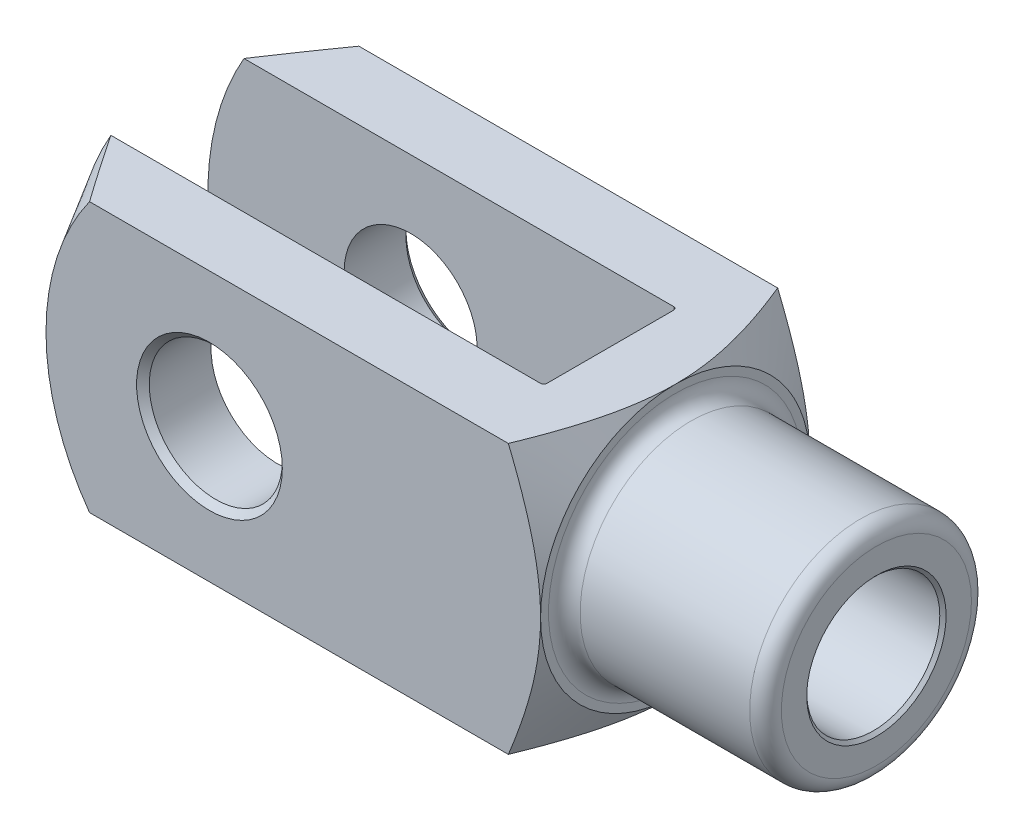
ISO-10303-21;
HEADER;
FILE_DESCRIPTION(('STEP AP214'),'2;1');
FILE_NAME('part.step','',(''),(''),'','','');
FILE_SCHEMA(('AUTOMOTIVE_DESIGN { 1 0 10303 214 1 1 1 1 }'));
ENDSEC;
DATA;
#1=APPLICATION_CONTEXT('core data for automotive mechanical design processes');
#2=APPLICATION_PROTOCOL_DEFINITION('international standard','automotive_design',2000,#1);
#3=PRODUCT_CONTEXT('',#1,'mechanical');
#4=PRODUCT('Part','Part','',(#3));
#5=PRODUCT_RELATED_PRODUCT_CATEGORY('part','',(#4));
#6=PRODUCT_DEFINITION_FORMATION('','',#4);
#7=PRODUCT_DEFINITION_CONTEXT('part definition',#1,'design');
#8=PRODUCT_DEFINITION('design','',#6,#7);
#9=PRODUCT_DEFINITION_SHAPE('','',#8);
#10=(LENGTH_UNIT() NAMED_UNIT(*) SI_UNIT(.MILLI.,.METRE.));
#11=(NAMED_UNIT(*) PLANE_ANGLE_UNIT() SI_UNIT($,.RADIAN.));
#12=(NAMED_UNIT(*) SI_UNIT($,.STERADIAN.) SOLID_ANGLE_UNIT());
#13=UNCERTAINTY_MEASURE_WITH_UNIT(LENGTH_MEASURE(1.E-05),#10,'distance_accuracy_value','');
#14=(GEOMETRIC_REPRESENTATION_CONTEXT(3) GLOBAL_UNCERTAINTY_ASSIGNED_CONTEXT((#13)) GLOBAL_UNIT_ASSIGNED_CONTEXT((#10,
#11,#12)) REPRESENTATION_CONTEXT('',''));
#15=CARTESIAN_POINT('',(0.,0.,0.));
#16=DIRECTION('',(0.,0.,1.));
#17=DIRECTION('',(1.,0.,0.));
#18=AXIS2_PLACEMENT_3D('',#15,#16,#17);
#19=CARTESIAN_POINT('',(-85.,-42.5,-20.));
#20=DIRECTION('',(0.,-1.,0.));
#21=DIRECTION('',(0.,0.,-1.));
#22=AXIS2_PLACEMENT_3D('',#19,#20,#21);
#23=CYLINDRICAL_SURFACE('',#22,1.);
#24=DIRECTION('',(0.,1.,0.));
#25=VECTOR('',#24,1.);
#26=CARTESIAN_POINT('',(-84.,-42.5,-20.));
#27=LINE('',#26,#25);
#28=CARTESIAN_POINT('',(-84.,-6.40312423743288,-20.));
#29=VERTEX_POINT('',#28);
#30=CARTESIAN_POINT('',(-84.,-42.5,-20.));
#31=VERTEX_POINT('',#30);
#32=EDGE_CURVE('E359',#29,#31,#27,.F.);
#33=ORIENTED_EDGE('',*,*,#32,.F.);
#34=CARTESIAN_POINT('',(-84.,-6.40312423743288,-20.));
#35=CARTESIAN_POINT('',(-84.0000045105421,-6.32329545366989,-20.0255578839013));
#36=CARTESIAN_POINT('',(-84.0009792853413,-6.24331961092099,-20.0506354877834));
#37=CARTESIAN_POINT('',(-84.0046878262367,-6.0831179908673,-20.0998182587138));
#38=CARTESIAN_POINT('',(-84.0074214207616,-6.00289223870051,-20.1239235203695));
#39=CARTESIAN_POINT('',(-84.0179843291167,-5.76197794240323,-20.1947424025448));
#40=CARTESIAN_POINT('',(-84.0281762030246,-5.60095791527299,-20.2399893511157));
#41=CARTESIAN_POINT('',(-84.0537226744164,-5.27845034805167,-20.3264804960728));
#42=CARTESIAN_POINT('',(-84.0690718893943,-5.11696346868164,-20.3677288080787));
#43=CARTESIAN_POINT('',(-84.1040755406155,-4.79347131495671,-20.4462796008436));
#44=CARTESIAN_POINT('',(-84.1237309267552,-4.63146593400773,-20.4835812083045));
#45=CARTESIAN_POINT('',(-84.1937852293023,-4.1014870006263,-20.5990155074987));
#46=CARTESIAN_POINT('',(-84.2515786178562,-3.73267093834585,-20.6689872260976));
#47=CARTESIAN_POINT('',(-84.3792336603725,-2.99389731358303,-20.7888622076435));
#48=CARTESIAN_POINT('',(-84.4491002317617,-2.62393934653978,-20.8387572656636));
#49=CARTESIAN_POINT('',(-84.6698690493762,-1.51273253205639,-20.9586901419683));
#50=CARTESIAN_POINT('',(-84.8319442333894,-0.770126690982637,-20.9989808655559));
#51=CARTESIAN_POINT('',(-84.9958806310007,-0.0188774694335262,-20.9999936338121));
#52=CARTESIAN_POINT('',(-84.997940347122,-0.00943866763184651,-20.9999999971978));
#53=CARTESIAN_POINT('',(-85.,0.,-21.));
#54=B_SPLINE_CURVE_WITH_KNOTS('',3,(#34,#35,#36,#37,#38,#39,#40,#41,#42,#43,#44,#45,#46,#47,#48,
#49,#50,#51,#52,#53),.UNSPECIFIED.,.F.,.F.,(4,2,2,2,2,2,2,2,2,4),(0.,0.251443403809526,
0.502862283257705,1.00540283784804,1.5074205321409,2.00954907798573,3.14800630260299,
4.28692832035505,6.56469795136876,6.59368071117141),.UNSPECIFIED.);
#55=CARTESIAN_POINT('',(-85.,0.,-21.));
#56=VERTEX_POINT('',#55);
#57=EDGE_CURVE('E391',#29,#56,#54,.T.);
#58=ORIENTED_EDGE('',*,*,#57,.T.);
#59=DIRECTION('',(0.,1.,0.));
#60=VECTOR('',#59,1.);
#61=CARTESIAN_POINT('',(-85.,42.5,-21.));
#62=LINE('',#61,#60);
#63=CARTESIAN_POINT('',(-85.,-42.5,-21.));
#64=VERTEX_POINT('',#63);
#65=EDGE_CURVE('E183',#64,#56,#62,.T.);
#66=ORIENTED_EDGE('',*,*,#65,.F.);
#67=CARTESIAN_POINT('',(-85.,-42.5,-20.));
#68=DIRECTION('',(0.,-1.,0.));
#69=DIRECTION('',(0.,0.,-1.));
#70=AXIS2_PLACEMENT_3D('',#67,#68,#69);
#71=CIRCLE('',#70,1.);
#72=EDGE_CURVE('E198',#31,#64,#71,.F.);
#73=ORIENTED_EDGE('',*,*,#72,.F.);
#74=EDGE_LOOP('',(#33,#58,#66,#73));
#75=FACE_BOUND('',#74,.T.);
#76=ADVANCED_FACE('F37',(#75),#23,.F.);
#77=CARTESIAN_POINT('',(-84.,-42.5,-21.));
#78=DIRECTION('',(1.,0.,0.));
#79=DIRECTION('',(0.,0.,-1.));
#80=AXIS2_PLACEMENT_3D('',#77,#78,#79);
#81=PLANE('',#80);
#82=CARTESIAN_POINT('',(-84.,42.5,-20.));
#83=VERTEX_POINT('',#82);
#84=CARTESIAN_POINT('',(-84.,6.40312423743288,-20.));
#85=VERTEX_POINT('',#84);
#86=EDGE_CURVE('E375',#83,#85,#27,.F.);
#87=ORIENTED_EDGE('',*,*,#86,.T.);
#88=CARTESIAN_POINT('',(-84.,0.,0.));
#89=DIRECTION('',(1.,0.,0.));
#90=DIRECTION('',(0.,0.,-1.));
#91=AXIS2_PLACEMENT_3D('',#88,#89,#90);
#92=CIRCLE('',#91,21.);
#93=CARTESIAN_POINT('',(-84.,6.40312423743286,20.));
#94=VERTEX_POINT('',#93);
#95=EDGE_CURVE('E751',#85,#94,#92,.T.);
#96=ORIENTED_EDGE('',*,*,#95,.T.);
#97=DIRECTION('',(0.,1.,0.));
#98=VECTOR('',#97,1.);
#99=CARTESIAN_POINT('',(-84.,42.5,20.));
#100=LINE('',#99,#98);
#101=CARTESIAN_POINT('',(-84.,42.5,20.));
#102=VERTEX_POINT('',#101);
#103=EDGE_CURVE('E160',#94,#102,#100,.T.);
#104=ORIENTED_EDGE('',*,*,#103,.T.);
#105=DIRECTION('',(0.,0.,-1.));
#106=VECTOR('',#105,1.);
#107=CARTESIAN_POINT('',(-84.,42.5,-21.));
#108=LINE('',#107,#106);
#109=EDGE_CURVE('E339',#102,#83,#108,.T.);
#110=ORIENTED_EDGE('',*,*,#109,.T.);
#111=EDGE_LOOP('',(#87,#96,#104,#110));
#112=FACE_BOUND('',#111,.T.);
#113=ADVANCED_FACE('F462',(#112),#81,.F.);
#114=CARTESIAN_POINT('',(-85.,-42.5,20.));
#115=DIRECTION('',(0.,-1.,0.));
#116=DIRECTION('',(0.,0.,-1.));
#117=AXIS2_PLACEMENT_3D('',#114,#115,#116);
#118=CYLINDRICAL_SURFACE('',#117,1.);
#119=ORIENTED_EDGE('',*,*,#103,.F.);
#120=CARTESIAN_POINT('',(-84.,6.40312423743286,20.));
#121=CARTESIAN_POINT('',(-84.0000045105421,6.32329545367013,20.0255578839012));
#122=CARTESIAN_POINT('',(-84.0009792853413,6.24331961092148,20.0506354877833));
#123=CARTESIAN_POINT('',(-84.0046878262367,6.08311799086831,20.0998182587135));
#124=CARTESIAN_POINT('',(-84.0074214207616,6.00289223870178,20.1239235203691));
#125=CARTESIAN_POINT('',(-84.0179843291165,5.76197794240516,20.1947424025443));
#126=CARTESIAN_POINT('',(-84.0281762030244,5.60095791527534,20.2399893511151));
#127=CARTESIAN_POINT('',(-84.0537226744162,5.27845034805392,20.3264804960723));
#128=CARTESIAN_POINT('',(-84.069071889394,5.11696346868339,20.3677288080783));
#129=CARTESIAN_POINT('',(-84.1040755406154,4.79347131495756,20.4462796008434));
#130=CARTESIAN_POINT('',(-84.1237309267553,4.63146593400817,20.4835812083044));
#131=CARTESIAN_POINT('',(-84.1937852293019,4.10148700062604,20.5990155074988));
#132=CARTESIAN_POINT('',(-84.2515786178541,3.73267093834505,20.6689872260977));
#133=CARTESIAN_POINT('',(-84.3792336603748,2.99389731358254,20.7888622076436));
#134=CARTESIAN_POINT('',(-84.4491002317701,2.62393934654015,20.8387572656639));
#135=CARTESIAN_POINT('',(-84.6698690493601,1.51273253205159,20.9586901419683));
#136=CARTESIAN_POINT('',(-84.8319442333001,0.77012669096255,20.9989808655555));
#137=CARTESIAN_POINT('',(-84.9958806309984,0.0188774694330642,20.9999936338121));
#138=CARTESIAN_POINT('',(-84.9979403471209,0.00943866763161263,20.9999999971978));
#139=CARTESIAN_POINT('',(-85.,0.,21.));
#140=B_SPLINE_CURVE_WITH_KNOTS('',3,(#120,#121,#122,#123,#124,#125,#126,#127,#128,#129,#130,
#131,#132,#133,#134,#135,#136,#137,#138,#139),.UNSPECIFIED.,.F.,.F.,(4,2,2,2,2,2,2,2,2,4),(0.,
0.251443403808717,0.502862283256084,1.00540283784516,1.50742053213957,2.00954907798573,
3.14800630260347,4.28692832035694,6.56469795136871,6.59368071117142),.UNSPECIFIED.);
#141=CARTESIAN_POINT('',(-85.,0.,21.));
#142=VERTEX_POINT('',#141);
#143=EDGE_CURVE('E145',#94,#142,#140,.T.);
#144=ORIENTED_EDGE('',*,*,#143,.T.);
#145=DIRECTION('',(0.,1.,0.));
#146=VECTOR('',#145,1.);
#147=CARTESIAN_POINT('',(-85.,-42.5,21.));
#148=LINE('',#147,#146);
#149=CARTESIAN_POINT('',(-85.,42.5,21.));
#150=VERTEX_POINT('',#149);
#151=EDGE_CURVE('E159',#150,#142,#148,.F.);
#152=ORIENTED_EDGE('',*,*,#151,.F.);
#153=CARTESIAN_POINT('',(-85.,42.5,20.));
#154=DIRECTION('',(0.,1.,0.));
#155=DIRECTION('',(0.,0.,1.));
#156=AXIS2_PLACEMENT_3D('',#153,#154,#155);
#157=CIRCLE('',#156,1.);
#158=EDGE_CURVE('E190',#102,#150,#157,.F.);
#159=ORIENTED_EDGE('',*,*,#158,.F.);
#160=EDGE_LOOP('',(#119,#144,#152,#159));
#161=FACE_BOUND('',#160,.T.);
#162=ADVANCED_FACE('F156',(#161),#118,.F.);
#163=CARTESIAN_POINT('',(-232.,-42.5,-21.));
#164=DIRECTION('',(0.,0.,-1.));
#165=DIRECTION('',(-1.,0.,0.));
#166=AXIS2_PLACEMENT_3D('',#163,#164,#165);
#167=PLANE('',#166);
#168=CARTESIAN_POINT('',(-168.,0.,-21.));
#169=DIRECTION('',(0.,0.,-1.));
#170=DIRECTION('',(-1.,0.,0.));
#171=AXIS2_PLACEMENT_3D('',#168,#169,#170);
#172=CIRCLE('',#171,21.);
#173=CARTESIAN_POINT('',(-189.,0.,-21.));
#174=VERTEX_POINT('',#173);
#175=EDGE_CURVE('E369',#174,#174,#172,.F.);
#176=ORIENTED_EDGE('',*,*,#175,.F.);
#177=EDGE_LOOP('',(#176));
#178=FACE_BOUND('',#177,.T.);
#179=CARTESIAN_POINT('',(-147.,0.,-21.));
#180=DIRECTION('',(0.,0.,1.));
#181=DIRECTION('',(1.,0.,0.));
#182=AXIS2_PLACEMENT_3D('',#179,#180,#181);
#183=CIRCLE('',#182,85.);
#184=CARTESIAN_POINT('',(-220.612159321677,42.5,-21.));
#185=VERTEX_POINT('',#184);
#186=CARTESIAN_POINT('',(-220.612159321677,-42.5,-21.));
#187=VERTEX_POINT('',#186);
#188=EDGE_CURVE('E277',#185,#187,#183,.T.);
#189=ORIENTED_EDGE('',*,*,#188,.T.);
#190=DIRECTION('',(-1.,0.,0.));
#191=VECTOR('',#190,1.);
#192=CARTESIAN_POINT('',(-232.,-42.5,-21.));
#193=LINE('',#192,#191);
#194=EDGE_CURVE('E334',#64,#187,#193,.T.);
#195=ORIENTED_EDGE('',*,*,#194,.F.);
#196=ORIENTED_EDGE('',*,*,#65,.T.);
#197=CARTESIAN_POINT('',(-85.,42.5,-21.));
#198=VERTEX_POINT('',#197);
#199=EDGE_CURVE('E179',#56,#198,#62,.T.);
#200=ORIENTED_EDGE('',*,*,#199,.T.);
#201=DIRECTION('',(-1.,0.,0.));
#202=VECTOR('',#201,1.);
#203=CARTESIAN_POINT('',(-232.,42.5,-21.));
#204=LINE('',#203,#202);
#205=EDGE_CURVE('E347',#198,#185,#204,.T.);
#206=ORIENTED_EDGE('',*,*,#205,.T.);
#207=EDGE_LOOP('',(#189,#195,#196,#200,#206));
#208=FACE_BOUND('',#207,.T.);
#209=ADVANCED_FACE('F394',(#178,#208),#167,.F.);
#210=CARTESIAN_POINT('',(-232.,-42.5,21.0000000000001));
#211=DIRECTION('',(0.,0.,1.));
#212=DIRECTION('',(1.,0.,0.));
#213=AXIS2_PLACEMENT_3D('',#210,#211,#212);
#214=PLANE('',#213);
#215=CARTESIAN_POINT('',(-168.,0.,21.));
#216=DIRECTION('',(0.,0.,1.));
#217=DIRECTION('',(1.,0.,0.));
#218=AXIS2_PLACEMENT_3D('',#215,#216,#217);
#219=CIRCLE('',#218,21.);
#220=CARTESIAN_POINT('',(-147.,0.,21.));
#221=VERTEX_POINT('',#220);
#222=EDGE_CURVE('E346',#221,#221,#219,.F.);
#223=ORIENTED_EDGE('',*,*,#222,.F.);
#224=EDGE_LOOP('',(#223));
#225=FACE_BOUND('',#224,.T.);
#226=DIRECTION('',(1.,0.,0.));
#227=VECTOR('',#226,1.);
#228=CARTESIAN_POINT('',(-232.,-42.5,21.0000000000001));
#229=LINE('',#228,#227);
#230=CARTESIAN_POINT('',(-220.612159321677,-42.5,21.0000000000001));
#231=VERTEX_POINT('',#230);
#232=CARTESIAN_POINT('',(-85.,-42.5,21.));
#233=VERTEX_POINT('',#232);
#234=EDGE_CURVE('E338',#231,#233,#229,.T.);
#235=ORIENTED_EDGE('',*,*,#234,.F.);
#236=CARTESIAN_POINT('',(-147.,0.,21.0000000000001));
#237=DIRECTION('',(0.,0.,1.));
#238=DIRECTION('',(1.,0.,0.));
#239=AXIS2_PLACEMENT_3D('',#236,#237,#238);
#240=CIRCLE('',#239,85.);
#241=CARTESIAN_POINT('',(-220.612159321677,42.5,21.0000000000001));
#242=VERTEX_POINT('',#241);
#243=EDGE_CURVE('E414',#242,#231,#240,.T.);
#244=ORIENTED_EDGE('',*,*,#243,.F.);
#245=DIRECTION('',(1.,0.,0.));
#246=VECTOR('',#245,1.);
#247=CARTESIAN_POINT('',(-232.,42.5,21.0000000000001));
#248=LINE('',#247,#246);
#249=EDGE_CURVE('E176',#242,#150,#248,.T.);
#250=ORIENTED_EDGE('',*,*,#249,.T.);
#251=ORIENTED_EDGE('',*,*,#151,.T.);
#252=EDGE_CURVE('E164',#142,#233,#148,.F.);
#253=ORIENTED_EDGE('',*,*,#252,.T.);
#254=EDGE_LOOP('',(#235,#244,#250,#251,#253));
#255=FACE_BOUND('',#254,.T.);
#256=ADVANCED_FACE('F173',(#225,#255),#214,.F.);
#257=CARTESIAN_POINT('',(-232.,-42.5,42.5));
#258=DIRECTION('',(0.,0.,1.));
#259=DIRECTION('',(1.,0.,0.));
#260=AXIS2_PLACEMENT_3D('',#257,#258,#259);
#261=PLANE('',#260);
#262=CARTESIAN_POINT('',(-168.,0.,42.5));
#263=DIRECTION('',(0.,0.,1.));
#264=DIRECTION('',(1.,0.,0.));
#265=AXIS2_PLACEMENT_3D('',#262,#263,#264);
#266=CIRCLE('',#265,23.);
#267=CARTESIAN_POINT('',(-145.,0.,42.5));
#268=VERTEX_POINT('',#267);
#269=EDGE_CURVE('E229',#268,#268,#266,.F.);
#270=ORIENTED_EDGE('',*,*,#269,.T.);
#271=EDGE_LOOP('',(#270));
#272=FACE_BOUND('',#271,.T.);
#273=DIRECTION('',(1.,0.,0.));
#274=VECTOR('',#273,1.);
#275=CARTESIAN_POINT('',(-232.,42.5,42.5));
#276=LINE('',#275,#274);
#277=CARTESIAN_POINT('',(-205.844014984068,42.5,42.5));
#278=VERTEX_POINT('',#277);
#279=CARTESIAN_POINT('',(-73.6637182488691,42.5,42.5));
#280=VERTEX_POINT('',#279);
#281=EDGE_CURVE('E366',#278,#280,#276,.T.);
#282=ORIENTED_EDGE('',*,*,#281,.F.);
#283=CARTESIAN_POINT('',(-147.,0.,42.5));
#284=DIRECTION('',(0.,0.,1.));
#285=DIRECTION('',(1.,0.,0.));
#286=AXIS2_PLACEMENT_3D('',#283,#284,#285);
#287=CIRCLE('',#286,72.586969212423);
#288=CARTESIAN_POINT('',(-205.844014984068,-42.5,42.5));
#289=VERTEX_POINT('',#288);
#290=EDGE_CURVE('E61',#278,#289,#287,.T.);
#291=ORIENTED_EDGE('',*,*,#290,.T.);
#292=DIRECTION('',(1.,0.,0.));
#293=VECTOR('',#292,1.);
#294=CARTESIAN_POINT('',(-232.,-42.5,42.5));
#295=LINE('',#294,#293);
#296=CARTESIAN_POINT('',(-73.6637182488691,-42.5,42.5));
#297=VERTEX_POINT('',#296);
#298=EDGE_CURVE('E363',#289,#297,#295,.T.);
#299=ORIENTED_EDGE('',*,*,#298,.T.);
#300=CARTESIAN_POINT('',(-94.7624622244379,-86.802185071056,42.5));
#301=CARTESIAN_POINT('',(-94.2194099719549,-85.7548832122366,42.5));
#302=CARTESIAN_POINT('',(-93.6778422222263,-84.7068103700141,42.5));
#303=CARTESIAN_POINT('',(-92.5980017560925,-82.6089645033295,42.5));
#304=CARTESIAN_POINT('',(-92.0597290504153,-81.5591914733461,42.5));
#305=CARTESIAN_POINT('',(-90.9867800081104,-79.4577385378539,42.5));
#306=CARTESIAN_POINT('',(-90.4521038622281,-78.4060585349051,42.5));
#307=CARTESIAN_POINT('',(-89.3867656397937,-76.3006688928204,42.5));
#308=CARTESIAN_POINT('',(-88.8561035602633,-75.2469592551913,42.5));
#309=CARTESIAN_POINT('',(-87.2689305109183,-72.0788197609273,42.5));
#310=CARTESIAN_POINT('',(-86.2191025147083,-69.9610344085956,42.5));
#311=CARTESIAN_POINT('',(-84.1415102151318,-65.7146875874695,42.5));
#312=CARTESIAN_POINT('',(-83.1137455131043,-63.5861263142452,42.5));
#313=CARTESIAN_POINT('',(-81.5617563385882,-60.3176996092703,42.5));
#314=CARTESIAN_POINT('',(-81.0275478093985,-59.1825730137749,42.5));
#315=CARTESIAN_POINT('',(-79.9680476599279,-56.9081600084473,42.5));
#316=CARTESIAN_POINT('',(-79.442756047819,-55.7688735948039,42.5));
#317=CARTESIAN_POINT('',(-78.4023058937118,-53.4855999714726,42.5));
#318=CARTESIAN_POINT('',(-77.8871479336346,-52.3416124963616,42.5));
#319=CARTESIAN_POINT('',(-76.8684714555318,-50.0484628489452,42.5));
#320=CARTESIAN_POINT('',(-76.3649529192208,-48.8993006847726,42.5));
#321=CARTESIAN_POINT('',(-75.3715128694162,-46.5957089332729,42.5));
#322=CARTESIAN_POINT('',(-74.8815854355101,-45.4412819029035,42.5));
#323=CARTESIAN_POINT('',(-73.9171459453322,-43.125985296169,42.5));
#324=CARTESIAN_POINT('',(-73.4426340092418,-41.9651156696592,42.5));
#325=CARTESIAN_POINT('',(-72.5114996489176,-39.6363326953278,42.5));
#326=CARTESIAN_POINT('',(-72.0548755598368,-38.4684200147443,42.5));
#327=CARTESIAN_POINT('',(-71.1623541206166,-36.1247217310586,42.5));
#328=CARTESIAN_POINT('',(-70.7264562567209,-34.9489363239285,42.5));
#329=CARTESIAN_POINT('',(-69.7868235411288,-32.3328103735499,42.5));
#330=CARTESIAN_POINT('',(-69.2888706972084,-30.8903806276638,42.5));
#331=CARTESIAN_POINT('',(-68.3357729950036,-27.9913739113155,42.5));
#332=CARTESIAN_POINT('',(-67.8806281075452,-26.5347969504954,42.5));
#333=CARTESIAN_POINT('',(-67.021661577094,-23.606572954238,42.5));
#334=CARTESIAN_POINT('',(-66.6178366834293,-22.1349268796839,42.5));
#335=CARTESIAN_POINT('',(-65.8711311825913,-19.1761541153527,42.5));
#336=CARTESIAN_POINT('',(-65.5282498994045,-17.6890275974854,42.5));
#337=CARTESIAN_POINT('',(-64.9209851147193,-14.7349663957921,42.5));
#338=CARTESIAN_POINT('',(-64.6549478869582,-13.2683771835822,42.5));
#339=CARTESIAN_POINT('',(-64.3138855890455,-11.0596120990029,42.5));
#340=CARTESIAN_POINT('',(-64.2098605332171,-10.3218450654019,42.5));
#341=CARTESIAN_POINT('',(-64.0221574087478,-8.84373890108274,42.5));
#342=CARTESIAN_POINT('',(-63.9384783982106,-8.10339989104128,42.5));
#343=CARTESIAN_POINT('',(-63.7924057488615,-6.62108367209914,42.5));
#344=CARTESIAN_POINT('',(-63.7299989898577,-5.87910775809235,42.5));
#345=CARTESIAN_POINT('',(-63.627097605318,-4.39363091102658,42.5));
#346=CARTESIAN_POINT('',(-63.5866029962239,-3.65012997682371,42.5));
#347=CARTESIAN_POINT('',(-63.527999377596,-2.16226315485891,42.5));
#348=CARTESIAN_POINT('',(-63.5098897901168,-1.41789728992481,42.5));
#349=CARTESIAN_POINT('',(-63.4962705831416,0.0710389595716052,42.5));
#350=CARTESIAN_POINT('',(-63.5007608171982,0.815609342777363,42.5));
#351=CARTESIAN_POINT('',(-63.5311360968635,2.25000394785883,42.5));
#352=CARTESIAN_POINT('',(-63.5554376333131,2.93986229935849,42.5));
#353=CARTESIAN_POINT('',(-63.6231690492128,4.31866339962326,42.5));
#354=CARTESIAN_POINT('',(-63.6665996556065,5.00760611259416,42.5));
#355=CARTESIAN_POINT('',(-63.7721581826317,6.38402120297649,42.5));
#356=CARTESIAN_POINT('',(-63.8342851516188,7.07149365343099,42.5));
#357=CARTESIAN_POINT('',(-63.976638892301,8.4445713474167,42.5));
#358=CARTESIAN_POINT('',(-64.0568664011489,9.1301765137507,42.5));
#359=CARTESIAN_POINT('',(-64.3237239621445,11.1842300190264,42.5));
#360=CARTESIAN_POINT('',(-64.5364846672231,12.5493513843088,42.5));
#361=CARTESIAN_POINT('',(-65.0246976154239,15.2681897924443,42.5));
#362=CARTESIAN_POINT('',(-65.30015160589,16.6219065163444,42.5));
#363=CARTESIAN_POINT('',(-65.9148507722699,19.3558887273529,42.5));
#364=CARTESIAN_POINT('',(-66.2557115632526,20.7357885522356,42.5));
#365=CARTESIAN_POINT('',(-66.987473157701,23.482186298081,42.5));
#366=CARTESIAN_POINT('',(-67.3783744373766,24.8486840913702,42.5));
#367=CARTESIAN_POINT('',(-67.9965846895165,26.8886415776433,42.5));
#368=CARTESIAN_POINT('',(-68.207962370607,27.566989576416,42.5));
#369=CARTESIAN_POINT('',(-68.6405021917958,28.9205642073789,42.5));
#370=CARTESIAN_POINT('',(-68.861664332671,29.5957908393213,42.5));
#371=CARTESIAN_POINT('',(-69.3129567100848,30.9431916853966,42.5));
#372=CARTESIAN_POINT('',(-69.5430864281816,31.6153660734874,42.5));
#373=CARTESIAN_POINT('',(-70.0115928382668,32.9568269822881,42.5));
#374=CARTESIAN_POINT('',(-70.2499695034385,33.6261135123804,42.5));
#375=CARTESIAN_POINT('',(-71.0159037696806,35.7387134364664,42.5));
#376=CARTESIAN_POINT('',(-71.5573694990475,37.1769980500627,42.5));
#377=CARTESIAN_POINT('',(-72.6696994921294,40.0421880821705,42.5));
#378=CARTESIAN_POINT('',(-73.2405655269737,41.4690928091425,42.5));
#379=CARTESIAN_POINT('',(-74.4069494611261,44.3131447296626,42.5));
#380=CARTESIAN_POINT('',(-75.0024728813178,45.7302896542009,42.5));
#381=CARTESIAN_POINT('',(-76.2140693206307,48.5557146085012,42.5));
#382=CARTESIAN_POINT('',(-76.8301419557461,49.9639948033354,42.5));
#383=CARTESIAN_POINT('',(-78.0801587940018,52.7740443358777,42.5));
#384=CARTESIAN_POINT('',(-78.714117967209,54.1758070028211,42.5));
#385=CARTESIAN_POINT('',(-79.9967583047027,56.9725772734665,42.5));
#386=CARTESIAN_POINT('',(-80.6454395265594,58.3675848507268,42.5));
#387=CARTESIAN_POINT('',(-81.9552829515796,61.151528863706,42.5));
#388=CARTESIAN_POINT('',(-82.6164437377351,62.5404659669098,42.5));
#389=CARTESIAN_POINT('',(-83.9495345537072,65.3131546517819,42.5));
#390=CARTESIAN_POINT('',(-84.6214645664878,66.6969062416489,42.5));
#391=CARTESIAN_POINT('',(-85.9766807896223,69.4640622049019,42.5));
#392=CARTESIAN_POINT('',(-86.6599953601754,70.8474526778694,42.5));
#393=CARTESIAN_POINT('',(-88.0347375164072,73.6101941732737,42.5));
#394=CARTESIAN_POINT('',(-88.7261651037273,74.989545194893,42.5));
#395=CARTESIAN_POINT('',(-90.1161082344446,77.7447032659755,42.5));
#396=CARTESIAN_POINT('',(-90.8146239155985,79.1205102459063,42.5));
#397=CARTESIAN_POINT('',(-92.217863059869,81.8689559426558,42.5));
#398=CARTESIAN_POINT('',(-92.9225865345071,83.2415946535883,42.5));
#399=CARTESIAN_POINT('',(-95.0442272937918,87.3539331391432,42.5));
#400=CARTESIAN_POINT('',(-96.469306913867,90.0894231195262,42.5));
#401=CARTESIAN_POINT('',(-99.3365319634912,95.5514018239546,42.5));
#402=CARTESIAN_POINT('',(-100.778677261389,98.2778906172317,42.5));
#403=CARTESIAN_POINT('',(-103.461460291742,103.319219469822,42.5));
#404=CARTESIAN_POINT('',(-104.700217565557,105.635061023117,42.5));
#405=CARTESIAN_POINT('',(-107.186029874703,110.262287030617,42.5));
#406=CARTESIAN_POINT('',(-108.433084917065,112.573671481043,42.5));
#407=CARTESIAN_POINT('',(-110.934369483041,117.192973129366,42.5));
#408=CARTESIAN_POINT('',(-112.188599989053,119.500889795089,42.5));
#409=CARTESIAN_POINT('',(-114.70302010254,124.113474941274,42.5));
#410=CARTESIAN_POINT('',(-115.96320971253,126.418143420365,42.5));
#411=CARTESIAN_POINT('',(-118.481465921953,131.011484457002,42.5));
#412=CARTESIAN_POINT('',(-119.739503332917,133.300173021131,42.5));
#413=CARTESIAN_POINT('',(-122.259947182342,137.875143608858,42.5));
#414=CARTESIAN_POINT('',(-123.522353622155,140.16142563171,42.5));
#415=CARTESIAN_POINT('',(-126.050763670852,144.731527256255,42.5));
#416=CARTESIAN_POINT('',(-127.316766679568,147.015347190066,42.5));
#417=CARTESIAN_POINT('',(-129.852109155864,151.581131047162,42.5));
#418=CARTESIAN_POINT('',(-131.121448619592,153.863094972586,42.5));
#419=CARTESIAN_POINT('',(-132.392228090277,156.14425578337,42.5));
#420=B_SPLINE_CURVE_WITH_KNOTS('',3,(#300,#301,#302,#303,#304,#305,#306,#307,#308,#309,#310,
#311,#312,#313,#314,#315,#316,#317,#318,#319,#320,#321,#322,#323,#324,#325,#326,#327,#328,#329,
#330,#331,#332,#333,#334,#335,#336,#337,#338,#339,#340,#341,#342,#343,#344,#345,#346,#347,#348,
#349,#350,#351,#352,#353,#354,#355,#356,#357,#358,#359,#360,#361,#362,#363,#364,#365,#366,#367,
#368,#369,#370,#371,#372,#373,#374,#375,#376,#377,#378,#379,#380,#381,#382,#383,#384,#385,#386,
#387,#388,#389,#390,#391,#392,#393,#394,#395,#396,#397,#398,#399,#400,#401,#402,#403,#404,#405,
#406,#407,#408,#409,#410,#411,#412,#413,#414,#415,#416,#417,#418,#419),.UNSPECIFIED.,.F.,.F.,(4,
2,2,2,2,2,2,2,2,2,2,2,2,2,2,2,2,2,2,2,2,2,2,2,2,2,2,2,2,2,2,2,2,2,2,2,2,2,2,2,2,2,2,2,2,2,2,2,2,
2,2,2,2,2,2,2,2,2,2,4),(0.,3.53917010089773,7.0783517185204,10.6177195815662,14.1570848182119,
21.2481316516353,28.3390502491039,32.102663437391,35.8662800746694,39.6301122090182,
43.3939384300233,47.1560984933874,50.9182878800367,54.6801262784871,58.4418713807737,
63.0191904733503,67.5965064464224,72.1735323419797,76.7505074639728,81.2200421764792,
83.4550010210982,85.6898563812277,87.9233308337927,90.1568069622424,92.3902254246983,
94.623629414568,96.6942218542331,98.7648929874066,100.835458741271,102.906108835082,
107.049107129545,111.192220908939,115.455253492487,119.718326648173,121.849823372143,
123.981320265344,126.112694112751,128.244061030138,132.8541145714,137.464446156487,
142.075815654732,146.687099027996,151.30236351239,155.917646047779,160.53240765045,
165.147161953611,169.7759750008,174.404788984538,179.033693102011,183.662605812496,
192.915832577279,202.168988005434,210.047977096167,217.926972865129,225.807074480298,
233.68717942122,241.522145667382,249.357114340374,257.19084450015,265.024565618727),.UNSPECIFIED.);
#421=CARTESIAN_POINT('',(-63.5,0.,42.5));
#422=VERTEX_POINT('',#421);
#423=EDGE_CURVE('E306',#422,#297,#420,.F.);
#424=ORIENTED_EDGE('',*,*,#423,.F.);
#425=EDGE_CURVE('E304',#280,#422,#420,.F.);
#426=ORIENTED_EDGE('',*,*,#425,.F.);
#427=EDGE_LOOP('',(#282,#291,#299,#424,#426));
#428=FACE_BOUND('',#427,.T.);
#429=ADVANCED_FACE('F288',(#272,#428),#261,.T.);
#430=CARTESIAN_POINT('',(-232.,-42.5,42.5));
#431=DIRECTION('',(0.,-1.,0.));
#432=DIRECTION('',(0.,0.,-1.));
#433=AXIS2_PLACEMENT_3D('',#430,#431,#432);
#434=PLANE('',#433);
#435=ORIENTED_EDGE('',*,*,#194,.T.);
#436=CARTESIAN_POINT('',(-254.259121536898,-42.5,31.6063783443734));
#437=CARTESIAN_POINT('',(-253.224318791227,-42.5,29.9400996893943));
#438=CARTESIAN_POINT('',(-252.188060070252,-42.5,28.2747245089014));
#439=CARTESIAN_POINT('',(-250.11234990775,-42.5,24.9459626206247));
#440=CARTESIAN_POINT('',(-249.072898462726,-42.5,23.2825759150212));
#441=CARTESIAN_POINT('',(-246.990503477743,-42.5,19.9579428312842));
#442=CARTESIAN_POINT('',(-245.947559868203,-42.5,18.2966964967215));
#443=CARTESIAN_POINT('',(-243.857874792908,-42.5,14.9765951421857));
#444=CARTESIAN_POINT('',(-242.811133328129,-42.5,13.3177401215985));
#445=CARTESIAN_POINT('',(-239.662149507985,-42.5,8.34111474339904));
#446=CARTESIAN_POINT('',(-237.553657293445,-42.5,5.02729451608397));
#447=CARTESIAN_POINT('',(-233.316537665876,-42.5,-1.58742420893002));
#448=CARTESIAN_POINT('',(-231.18791042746,-42.5,-4.88832281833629));
#449=CARTESIAN_POINT('',(-227.93107397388,-42.5,-9.89719201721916));
#450=CARTESIAN_POINT('',(-226.811906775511,-42.5,-11.6110434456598));
#451=CARTESIAN_POINT('',(-224.565991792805,-42.5,-15.0337706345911));
#452=CARTESIAN_POINT('',(-223.439244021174,-42.5,-16.7426464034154));
#453=CARTESIAN_POINT('',(-221.177182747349,-42.5,-20.1547865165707));
#454=CARTESIAN_POINT('',(-220.041869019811,-42.5,-21.8580507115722));
#455=CARTESIAN_POINT('',(-217.761573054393,-42.5,-25.2580964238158));
#456=CARTESIAN_POINT('',(-216.616590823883,-42.5,-26.9548779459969));
#457=CARTESIAN_POINT('',(-214.316494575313,-42.5,-30.3396627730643));
#458=CARTESIAN_POINT('',(-213.161389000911,-42.5,-32.027671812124));
#459=CARTESIAN_POINT('',(-210.838567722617,-42.5,-35.3950071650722));
#460=CARTESIAN_POINT('',(-209.670851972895,-42.5,-37.0743334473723));
#461=CARTESIAN_POINT('',(-207.320923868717,-42.5,-40.422704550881));
#462=CARTESIAN_POINT('',(-206.138712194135,-42.5,-42.091749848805));
#463=CARTESIAN_POINT('',(-203.757375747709,-42.5,-45.4177189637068));
#464=CARTESIAN_POINT('',(-202.558251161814,-42.5,-47.074642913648));
#465=CARTESIAN_POINT('',(-200.1515804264,-42.5,-50.3583415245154));
#466=CARTESIAN_POINT('',(-198.944221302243,-42.5,-51.9852531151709));
#467=CARTESIAN_POINT('',(-196.506431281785,-42.5,-55.2217982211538));
#468=CARTESIAN_POINT('',(-195.275999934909,-42.5,-56.8314313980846));
#469=CARTESIAN_POINT('',(-193.408811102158,-42.5,-59.2309169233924));
#470=CARTESIAN_POINT('',(-192.782375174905,-42.5,-60.0288087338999));
#471=CARTESIAN_POINT('',(-191.5218982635,-42.5,-61.6185589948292));
#472=CARTESIAN_POINT('',(-190.887857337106,-42.5,-62.4104174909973));
#473=CARTESIAN_POINT('',(-189.611424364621,-42.5,-63.9873278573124));
#474=CARTESIAN_POINT('',(-188.969032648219,-42.5,-64.7723799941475));
#475=CARTESIAN_POINT('',(-187.674999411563,-42.5,-66.334814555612));
#476=CARTESIAN_POINT('',(-187.02335800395,-42.5,-67.1121970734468));
#477=CARTESIAN_POINT('',(-185.716751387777,-42.5,-68.6500819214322));
#478=CARTESIAN_POINT('',(-185.061894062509,-42.5,-69.4106758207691));
#479=CARTESIAN_POINT('',(-183.741010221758,-42.5,-70.9221195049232));
#480=CARTESIAN_POINT('',(-183.074983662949,-42.5,-71.6729692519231));
#481=CARTESIAN_POINT('',(-181.730291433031,-42.5,-73.1636617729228));
#482=CARTESIAN_POINT('',(-181.051622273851,-42.5,-73.9035014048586));
#483=CARTESIAN_POINT('',(-179.680353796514,-42.5,-75.3701645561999));
#484=CARTESIAN_POINT('',(-178.987754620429,-42.5,-76.0969882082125));
#485=CARTESIAN_POINT('',(-177.588511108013,-42.5,-77.533796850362));
#486=CARTESIAN_POINT('',(-176.881902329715,-42.5,-78.2438164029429));
#487=CARTESIAN_POINT('',(-175.451135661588,-42.5,-79.6460631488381));
#488=CARTESIAN_POINT('',(-174.726976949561,-42.5,-80.3382895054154));
#489=CARTESIAN_POINT('',(-173.259343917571,-42.5,-81.7011492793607));
#490=CARTESIAN_POINT('',(-172.515880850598,-42.5,-82.371794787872));
#491=CARTESIAN_POINT('',(-171.006813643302,-42.5,-83.6876063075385));
#492=CARTESIAN_POINT('',(-170.241212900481,-42.5,-84.3327761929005));
#493=CARTESIAN_POINT('',(-169.063354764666,-42.5,-85.286083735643));
#494=CARTESIAN_POINT('',(-168.660270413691,-42.5,-85.6055834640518));
#495=CARTESIAN_POINT('',(-167.8470950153,-42.5,-86.2355559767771));
#496=CARTESIAN_POINT('',(-167.437003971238,-42.5,-86.5460287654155));
#497=CARTESIAN_POINT('',(-166.609319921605,-42.5,-87.1570274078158));
#498=CARTESIAN_POINT('',(-166.191725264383,-42.5,-87.4575510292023));
#499=CARTESIAN_POINT('',(-165.348737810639,-42.5,-88.047434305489));
#500=CARTESIAN_POINT('',(-164.923345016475,-42.5,-88.3367939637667));
#501=CARTESIAN_POINT('',(-163.635508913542,-42.5,-89.1858557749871));
#502=CARTESIAN_POINT('',(-162.760703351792,-42.5,-89.7270659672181));
#503=CARTESIAN_POINT('',(-160.975814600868,-42.5,-90.7479148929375));
#504=CARTESIAN_POINT('',(-160.065740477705,-42.5,-91.2275693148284));
#505=CARTESIAN_POINT('',(-158.41697160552,-42.5,-92.011768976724));
#506=CARTESIAN_POINT('',(-157.685513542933,-42.5,-92.3314779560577));
#507=CARTESIAN_POINT('',(-156.201249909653,-42.5,-92.917125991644));
#508=CARTESIAN_POINT('',(-155.448446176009,-42.5,-93.1830696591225));
#509=CARTESIAN_POINT('',(-153.924642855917,-42.5,-93.6527486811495));
#510=CARTESIAN_POINT('',(-153.15367010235,-42.5,-93.8565702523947));
#511=CARTESIAN_POINT('',(-151.596542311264,-42.5,-94.1949605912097));
#512=CARTESIAN_POINT('',(-150.810387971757,-42.5,-94.3295325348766));
#513=CARTESIAN_POINT('',(-149.220937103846,-42.5,-94.5246248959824));
#514=CARTESIAN_POINT('',(-148.417547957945,-42.5,-94.5844008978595));
#515=CARTESIAN_POINT('',(-146.808795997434,-42.5,-94.6245958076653));
#516=CARTESIAN_POINT('',(-146.003433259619,-42.5,-94.60501775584));
#517=CARTESIAN_POINT('',(-144.398340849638,-42.5,-94.4874466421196));
#518=CARTESIAN_POINT('',(-143.59861244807,-42.5,-94.3894364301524));
#519=CARTESIAN_POINT('',(-142.011788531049,-42.5,-94.1194965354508));
#520=CARTESIAN_POINT('',(-141.224695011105,-42.5,-93.9475552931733));
#521=CARTESIAN_POINT('',(-139.521111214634,-42.5,-93.4978686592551));
#522=CARTESIAN_POINT('',(-138.608292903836,-42.5,-93.2062652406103));
#523=CARTESIAN_POINT('',(-136.812725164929,-42.5,-92.5422203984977));
#524=CARTESIAN_POINT('',(-135.929985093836,-42.5,-92.1697540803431));
#525=CARTESIAN_POINT('',(-134.193516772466,-42.5,-91.3564797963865));
#526=CARTESIAN_POINT('',(-133.339885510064,-42.5,-90.9154662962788));
#527=CARTESIAN_POINT('',(-132.082993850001,-42.5,-90.2125894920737));
#528=CARTESIAN_POINT('',(-131.667958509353,-42.5,-89.9714062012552));
#529=CARTESIAN_POINT('',(-130.845395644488,-42.5,-89.4765094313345));
#530=CARTESIAN_POINT('',(-130.437868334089,-42.5,-89.2227955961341));
#531=CARTESIAN_POINT('',(-129.495749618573,-42.5,-88.6178079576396));
#532=CARTESIAN_POINT('',(-128.963974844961,-42.5,-88.2621504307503));
#533=CARTESIAN_POINT('',(-127.912557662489,-42.5,-87.5332717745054));
#534=CARTESIAN_POINT('',(-127.392916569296,-42.5,-87.160048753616));
#535=CARTESIAN_POINT('',(-126.364842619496,-42.5,-86.3980920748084));
#536=CARTESIAN_POINT('',(-125.856414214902,-42.5,-86.0093524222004));
#537=CARTESIAN_POINT('',(-124.850167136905,-42.5,-85.2183409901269));
#538=CARTESIAN_POINT('',(-124.352349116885,-42.5,-84.8160683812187));
#539=CARTESIAN_POINT('',(-123.365687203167,-42.5,-83.9988596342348));
#540=CARTESIAN_POINT('',(-122.87686150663,-42.5,-83.5839015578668));
#541=CARTESIAN_POINT('',(-121.908395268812,-42.5,-82.7433882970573));
#542=CARTESIAN_POINT('',(-121.428755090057,-42.5,-82.3178326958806));
#543=CARTESIAN_POINT('',(-120.002808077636,-42.5,-81.0272915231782));
#544=CARTESIAN_POINT('',(-119.069222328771,-42.5,-80.148220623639));
#545=CARTESIAN_POINT('',(-117.225141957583,-42.5,-78.3542980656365));
#546=CARTESIAN_POINT('',(-116.314842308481,-42.5,-77.4392472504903));
#547=CARTESIAN_POINT('',(-114.519610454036,-42.5,-75.584585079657));
#548=CARTESIAN_POINT('',(-113.63467919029,-42.5,-74.6449728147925));
#549=CARTESIAN_POINT('',(-111.887660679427,-42.5,-72.7466100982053));
#550=CARTESIAN_POINT('',(-111.025550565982,-42.5,-71.7878806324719));
#551=CARTESIAN_POINT('',(-109.320349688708,-42.5,-69.8537259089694));
#552=CARTESIAN_POINT('',(-108.477258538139,-42.5,-68.8783009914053));
#553=CARTESIAN_POINT('',(-106.478662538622,-42.5,-66.5262542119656));
#554=CARTESIAN_POINT('',(-105.330964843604,-42.5,-65.1430027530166));
#555=CARTESIAN_POINT('',(-103.062189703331,-42.5,-62.354453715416));
#556=CARTESIAN_POINT('',(-101.941117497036,-42.5,-60.9491518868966));
#557=CARTESIAN_POINT('',(-100.284893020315,-42.5,-58.8385608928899));
#558=CARTESIAN_POINT('',(-99.7411486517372,-42.5,-58.1399899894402));
#559=CARTESIAN_POINT('',(-98.6587397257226,-42.5,-56.7389200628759));
#560=CARTESIAN_POINT('',(-98.1200751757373,-42.5,-56.0364210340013));
#561=CARTESIAN_POINT('',(-97.0475991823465,-42.5,-54.628058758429));
#562=CARTESIAN_POINT('',(-96.5137863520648,-42.5,-53.9221965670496));
#563=CARTESIAN_POINT('',(-95.450520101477,-42.5,-52.5072061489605));
#564=CARTESIAN_POINT('',(-94.9210666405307,-42.5,-51.7980779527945));
#565=CARTESIAN_POINT('',(-94.3936216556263,-42.5,-51.087462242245));
#566=B_SPLINE_CURVE_WITH_KNOTS('',3,(#436,#437,#438,#439,#440,#441,#442,#443,#444,#445,#446,
#447,#448,#449,#450,#451,#452,#453,#454,#455,#456,#457,#458,#459,#460,#461,#462,#463,#464,#465,
#466,#467,#468,#469,#470,#471,#472,#473,#474,#475,#476,#477,#478,#479,#480,#481,#482,#483,#484,
#485,#486,#487,#488,#489,#490,#491,#492,#493,#494,#495,#496,#497,#498,#499,#500,#501,#502,#503,
#504,#505,#506,#507,#508,#509,#510,#511,#512,#513,#514,#515,#516,#517,#518,#519,#520,#521,#522,
#523,#524,#525,#526,#527,#528,#529,#530,#531,#532,#533,#534,#535,#536,#537,#538,#539,#540,#541,
#542,#543,#544,#545,#546,#547,#548,#549,#550,#551,#552,#553,#554,#555,#556,#557,#558,#559,#560,
#561,#562,#563,#564,#565),.UNSPECIFIED.,.F.,.F.,(4,2,2,2,2,2,2,2,2,2,2,2,2,2,2,2,2,2,2,2,2,2,2,
2,2,2,2,2,2,2,2,2,2,2,2,2,2,2,2,2,2,2,2,2,2,2,2,2,2,2,2,2,2,2,2,2,2,2,2,2,2,2,2,2,4),(0.,
5.88436173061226,11.7687299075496,17.6532160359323,23.5377006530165,35.3208624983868,
47.1039222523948,53.2446222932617,59.3853120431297,65.5261639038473,71.6670110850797,
77.8031487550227,83.9393087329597,90.0751820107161,96.2109878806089,102.28873999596,
108.366610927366,111.409841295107,114.453048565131,117.496136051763,120.539186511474,
123.550081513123,126.560988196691,129.572738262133,132.584457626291,135.589321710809,
138.594326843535,141.597617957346,144.600450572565,146.143399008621,147.686346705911,
149.229638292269,150.772929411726,153.856879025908,156.940041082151,159.333073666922,
161.725900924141,164.115391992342,166.504773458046,168.91775112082,171.330636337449,
173.744049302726,176.157839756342,179.028011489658,181.899068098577,184.778905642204,
186.218805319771,187.658745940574,189.577574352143,191.496609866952,193.416394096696,
195.336296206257,197.259730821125,199.183241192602,203.02927574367,206.900900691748,
210.772669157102,214.64039887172,218.508049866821,223.899775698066,229.292553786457,
231.948271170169,234.603992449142,237.258929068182,239.913840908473),.UNSPECIFIED.);
#567=CARTESIAN_POINT('',(-205.844014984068,-42.5,-42.5));
#568=VERTEX_POINT('',#567);
#569=EDGE_CURVE('E276',#187,#568,#566,.T.);
#570=ORIENTED_EDGE('',*,*,#569,.T.);
#571=DIRECTION('',(1.,0.,0.));
#572=VECTOR('',#571,1.);
#573=CARTESIAN_POINT('',(-232.,-42.5,-42.5));
#574=LINE('',#573,#572);
#575=CARTESIAN_POINT('',(-73.6637182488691,-42.5,-42.5));
#576=VERTEX_POINT('',#575);
#577=EDGE_CURVE('E360',#568,#576,#574,.T.);
#578=ORIENTED_EDGE('',*,*,#577,.T.);
#579=CARTESIAN_POINT('',(-94.7624622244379,-42.5,-86.802185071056));
#580=CARTESIAN_POINT('',(-94.2194099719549,-42.5,-85.7548832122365));
#581=CARTESIAN_POINT('',(-93.6778422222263,-42.5,-84.706810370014));
#582=CARTESIAN_POINT('',(-92.5980017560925,-42.5,-82.6089645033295));
#583=CARTESIAN_POINT('',(-92.0597290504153,-42.5,-81.5591914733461));
#584=CARTESIAN_POINT('',(-90.9867800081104,-42.5,-79.4577385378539));
#585=CARTESIAN_POINT('',(-90.4521038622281,-42.5,-78.4060585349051));
#586=CARTESIAN_POINT('',(-89.3867656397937,-42.5,-76.3006688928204));
#587=CARTESIAN_POINT('',(-88.8561035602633,-42.5,-75.2469592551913));
#588=CARTESIAN_POINT('',(-87.2689305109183,-42.5,-72.0788197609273));
#589=CARTESIAN_POINT('',(-86.2191025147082,-42.5,-69.9610344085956));
#590=CARTESIAN_POINT('',(-84.1415102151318,-42.5,-65.7146875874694));
#591=CARTESIAN_POINT('',(-83.1137455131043,-42.5,-63.5861263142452));
#592=CARTESIAN_POINT('',(-81.5617563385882,-42.5,-60.3176996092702));
#593=CARTESIAN_POINT('',(-81.0275478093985,-42.5,-59.1825730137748));
#594=CARTESIAN_POINT('',(-79.9680476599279,-42.5,-56.9081600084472));
#595=CARTESIAN_POINT('',(-79.442756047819,-42.5,-55.7688735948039));
#596=CARTESIAN_POINT('',(-78.4023058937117,-42.5,-53.4855999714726));
#597=CARTESIAN_POINT('',(-77.8871479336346,-42.5,-52.3416124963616));
#598=CARTESIAN_POINT('',(-76.8684714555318,-42.5,-50.0484628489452));
#599=CARTESIAN_POINT('',(-76.3649529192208,-42.5,-48.8993006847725));
#600=CARTESIAN_POINT('',(-75.3715128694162,-42.5,-46.5957089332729));
#601=CARTESIAN_POINT('',(-74.8815854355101,-42.5,-45.4412819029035));
#602=CARTESIAN_POINT('',(-73.9171459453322,-42.5,-43.125985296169));
#603=CARTESIAN_POINT('',(-73.4426340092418,-42.5,-41.9651156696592));
#604=CARTESIAN_POINT('',(-72.5114996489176,-42.5,-39.6363326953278));
#605=CARTESIAN_POINT('',(-72.0548755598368,-42.5,-38.4684200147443));
#606=CARTESIAN_POINT('',(-71.1623541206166,-42.5,-36.1247217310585));
#607=CARTESIAN_POINT('',(-70.7264562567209,-42.5,-34.9489363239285));
#608=CARTESIAN_POINT('',(-69.7868235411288,-42.5,-32.3328103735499));
#609=CARTESIAN_POINT('',(-69.2888706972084,-42.5,-30.8903806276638));
#610=CARTESIAN_POINT('',(-68.3357729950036,-42.5,-27.9913739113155));
#611=CARTESIAN_POINT('',(-67.8806281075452,-42.5,-26.5347969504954));
#612=CARTESIAN_POINT('',(-67.021661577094,-42.5,-23.606572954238));
#613=CARTESIAN_POINT('',(-66.6178366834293,-42.5,-22.1349268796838));
#614=CARTESIAN_POINT('',(-65.8711311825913,-42.5,-19.1761541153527));
#615=CARTESIAN_POINT('',(-65.5282498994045,-42.5,-17.6890275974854));
#616=CARTESIAN_POINT('',(-64.9209851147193,-42.5,-14.7349663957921));
#617=CARTESIAN_POINT('',(-64.6549478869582,-42.5,-13.2683771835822));
#618=CARTESIAN_POINT('',(-64.3138855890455,-42.5,-11.0596120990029));
#619=CARTESIAN_POINT('',(-64.2098605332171,-42.5,-10.3218450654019));
#620=CARTESIAN_POINT('',(-64.0221574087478,-42.5,-8.84373890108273));
#621=CARTESIAN_POINT('',(-63.9384783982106,-42.5,-8.10339989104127));
#622=CARTESIAN_POINT('',(-63.7924057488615,-42.5,-6.62108367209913));
#623=CARTESIAN_POINT('',(-63.7299989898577,-42.5,-5.87910775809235));
#624=CARTESIAN_POINT('',(-63.627097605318,-42.5,-4.39363091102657));
#625=CARTESIAN_POINT('',(-63.5866029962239,-42.5,-3.6501299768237));
#626=CARTESIAN_POINT('',(-63.527999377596,-42.5,-2.16226315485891));
#627=CARTESIAN_POINT('',(-63.5098897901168,-42.5,-1.4178972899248));
#628=CARTESIAN_POINT('',(-63.4962705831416,-42.5,0.0710389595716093));
#629=CARTESIAN_POINT('',(-63.5007608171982,-42.5,0.815609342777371));
#630=CARTESIAN_POINT('',(-63.5311360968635,-42.5,2.25000394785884));
#631=CARTESIAN_POINT('',(-63.5554376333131,-42.5,2.9398622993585));
#632=CARTESIAN_POINT('',(-63.6231690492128,-42.5,4.31866339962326));
#633=CARTESIAN_POINT('',(-63.6665996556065,-42.5,5.00760611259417));
#634=CARTESIAN_POINT('',(-63.7721581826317,-42.5,6.38402120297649));
#635=CARTESIAN_POINT('',(-63.8342851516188,-42.5,7.07149365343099));
#636=CARTESIAN_POINT('',(-63.976638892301,-42.5,8.4445713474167));
#637=CARTESIAN_POINT('',(-64.0568664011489,-42.5,9.1301765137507));
#638=CARTESIAN_POINT('',(-64.3237239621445,-42.5,11.1842300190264));
#639=CARTESIAN_POINT('',(-64.5364846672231,-42.5,12.5493513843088));
#640=CARTESIAN_POINT('',(-65.0246976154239,-42.5,15.2681897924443));
#641=CARTESIAN_POINT('',(-65.30015160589,-42.5,16.6219065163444));
#642=CARTESIAN_POINT('',(-65.9148507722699,-42.5,19.3558887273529));
#643=CARTESIAN_POINT('',(-66.2557115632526,-42.5,20.7357885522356));
#644=CARTESIAN_POINT('',(-66.987473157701,-42.5,23.482186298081));
#645=CARTESIAN_POINT('',(-67.3783744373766,-42.5,24.8486840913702));
#646=CARTESIAN_POINT('',(-67.9965846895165,-42.5,26.8886415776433));
#647=CARTESIAN_POINT('',(-68.207962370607,-42.5,27.566989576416));
#648=CARTESIAN_POINT('',(-68.6405021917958,-42.5,28.9205642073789));
#649=CARTESIAN_POINT('',(-68.861664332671,-42.5,29.5957908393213));
#650=CARTESIAN_POINT('',(-69.3129567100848,-42.5,30.9431916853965));
#651=CARTESIAN_POINT('',(-69.5430864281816,-42.5,31.6153660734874));
#652=CARTESIAN_POINT('',(-70.0115928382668,-42.5,32.9568269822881));
#653=CARTESIAN_POINT('',(-70.2499695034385,-42.5,33.6261135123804));
#654=CARTESIAN_POINT('',(-71.0159037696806,-42.5,35.7387134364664));
#655=CARTESIAN_POINT('',(-71.5573694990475,-42.5,37.1769980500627));
#656=CARTESIAN_POINT('',(-72.6696994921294,-42.5,40.0421880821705));
#657=CARTESIAN_POINT('',(-73.2405655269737,-42.5,41.4690928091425));
#658=CARTESIAN_POINT('',(-74.4069494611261,-42.5,44.3131447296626));
#659=CARTESIAN_POINT('',(-75.0024728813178,-42.5,45.7302896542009));
#660=CARTESIAN_POINT('',(-76.2140693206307,-42.5,48.5557146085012));
#661=CARTESIAN_POINT('',(-76.8301419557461,-42.5,49.9639948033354));
#662=CARTESIAN_POINT('',(-78.0801587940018,-42.5,52.7740443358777));
#663=CARTESIAN_POINT('',(-78.714117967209,-42.5,54.1758070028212));
#664=CARTESIAN_POINT('',(-79.9967583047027,-42.5,56.9725772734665));
#665=CARTESIAN_POINT('',(-80.6454395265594,-42.5,58.3675848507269));
#666=CARTESIAN_POINT('',(-81.9552829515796,-42.5,61.151528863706));
#667=CARTESIAN_POINT('',(-82.6164437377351,-42.5,62.5404659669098));
#668=CARTESIAN_POINT('',(-83.9495345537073,-42.5,65.3131546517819));
#669=CARTESIAN_POINT('',(-84.6214645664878,-42.5,66.696906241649));
#670=CARTESIAN_POINT('',(-85.9766807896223,-42.5,69.4640622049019));
#671=CARTESIAN_POINT('',(-86.6599953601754,-42.5,70.8474526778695));
#672=CARTESIAN_POINT('',(-88.0347375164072,-42.5,73.6101941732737));
#673=CARTESIAN_POINT('',(-88.7261651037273,-42.5,74.9895451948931));
#674=CARTESIAN_POINT('',(-90.1161082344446,-42.5,77.7447032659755));
#675=CARTESIAN_POINT('',(-90.8146239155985,-42.5,79.1205102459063));
#676=CARTESIAN_POINT('',(-92.217863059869,-42.5,81.8689559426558));
#677=CARTESIAN_POINT('',(-92.9225865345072,-42.5,83.2415946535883));
#678=CARTESIAN_POINT('',(-95.0442272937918,-42.5,87.3539331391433));
#679=CARTESIAN_POINT('',(-96.469306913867,-42.5,90.0894231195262));
#680=CARTESIAN_POINT('',(-99.3365319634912,-42.5,95.5514018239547));
#681=CARTESIAN_POINT('',(-100.778677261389,-42.5,98.2778906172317));
#682=CARTESIAN_POINT('',(-103.461460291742,-42.5,103.319219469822));
#683=CARTESIAN_POINT('',(-104.700217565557,-42.5,105.635061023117));
#684=CARTESIAN_POINT('',(-107.186029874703,-42.5,110.262287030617));
#685=CARTESIAN_POINT('',(-108.433084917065,-42.5,112.573671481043));
#686=CARTESIAN_POINT('',(-110.934369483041,-42.5,117.192973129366));
#687=CARTESIAN_POINT('',(-112.188599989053,-42.5,119.500889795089));
#688=CARTESIAN_POINT('',(-114.70302010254,-42.5,124.113474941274));
#689=CARTESIAN_POINT('',(-115.96320971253,-42.5,126.418143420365));
#690=CARTESIAN_POINT('',(-118.481465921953,-42.5,131.011484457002));
#691=CARTESIAN_POINT('',(-119.739503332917,-42.5,133.300173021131));
#692=CARTESIAN_POINT('',(-122.259947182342,-42.5,137.875143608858));
#693=CARTESIAN_POINT('',(-123.522353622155,-42.5,140.16142563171));
#694=CARTESIAN_POINT('',(-126.050763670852,-42.5,144.731527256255));
#695=CARTESIAN_POINT('',(-127.316766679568,-42.5,147.015347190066));
#696=CARTESIAN_POINT('',(-129.852109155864,-42.5,151.581131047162));
#697=CARTESIAN_POINT('',(-131.121448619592,-42.5,153.863094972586));
#698=CARTESIAN_POINT('',(-132.392228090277,-42.5,156.14425578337));
#699=B_SPLINE_CURVE_WITH_KNOTS('',3,(#579,#580,#581,#582,#583,#584,#585,#586,#587,#588,#589,
#590,#591,#592,#593,#594,#595,#596,#597,#598,#599,#600,#601,#602,#603,#604,#605,#606,#607,#608,
#609,#610,#611,#612,#613,#614,#615,#616,#617,#618,#619,#620,#621,#622,#623,#624,#625,#626,#627,
#628,#629,#630,#631,#632,#633,#634,#635,#636,#637,#638,#639,#640,#641,#642,#643,#644,#645,#646,
#647,#648,#649,#650,#651,#652,#653,#654,#655,#656,#657,#658,#659,#660,#661,#662,#663,#664,#665,
#666,#667,#668,#669,#670,#671,#672,#673,#674,#675,#676,#677,#678,#679,#680,#681,#682,#683,#684,
#685,#686,#687,#688,#689,#690,#691,#692,#693,#694,#695,#696,#697,#698),.UNSPECIFIED.,.F.,.F.,(4,
2,2,2,2,2,2,2,2,2,2,2,2,2,2,2,2,2,2,2,2,2,2,2,2,2,2,2,2,2,2,2,2,2,2,2,2,2,2,2,2,2,2,2,2,2,2,2,2,
2,2,2,2,2,2,2,2,2,2,4),(0.,3.53917010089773,7.0783517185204,10.6177195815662,14.1570848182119,
21.2481316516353,28.3390502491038,32.102663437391,35.8662800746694,39.6301122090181,
43.3939384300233,47.1560984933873,50.9182878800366,54.680126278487,58.4418713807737,
63.0191904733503,67.5965064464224,72.1735323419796,76.7505074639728,81.2200421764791,
83.4550010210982,85.6898563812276,87.9233308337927,90.1568069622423,92.3902254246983,
94.623629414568,96.6942218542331,98.7648929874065,100.835458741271,102.906108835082,
107.049107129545,111.192220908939,115.455253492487,119.718326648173,121.849823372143,
123.981320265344,126.112694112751,128.244061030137,132.8541145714,137.464446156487,
142.075815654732,146.687099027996,151.30236351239,155.917646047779,160.53240765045,
165.147161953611,169.7759750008,174.404788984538,179.033693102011,183.662605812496,
192.915832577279,202.168988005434,210.047977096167,217.926972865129,225.807074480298,
233.68717942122,241.522145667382,249.357114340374,257.19084450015,265.024565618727),.UNSPECIFIED.);
#700=CARTESIAN_POINT('',(-63.5,-42.5,0.));
#701=VERTEX_POINT('',#700);
#702=EDGE_CURVE('E305',#701,#576,#699,.F.);
#703=ORIENTED_EDGE('',*,*,#702,.F.);
#704=EDGE_CURVE('E296',#297,#701,#699,.F.);
#705=ORIENTED_EDGE('',*,*,#704,.F.);
#706=ORIENTED_EDGE('',*,*,#298,.F.);
#707=CARTESIAN_POINT('',(-94.3936216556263,-42.5,51.0874622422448));
#708=CARTESIAN_POINT('',(-94.8248870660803,-42.5,51.668504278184));
#709=CARTESIAN_POINT('',(-95.2574981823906,-42.5,52.2485467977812));
#710=CARTESIAN_POINT('',(-96.1255935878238,-42.5,53.4064823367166));
#711=CARTESIAN_POINT('',(-96.5610778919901,-42.5,53.9843753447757));
#712=CARTESIAN_POINT('',(-97.8721624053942,-42.5,55.7146691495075));
#713=CARTESIAN_POINT('',(-98.7523390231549,-42.5,56.8636102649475));
#714=CARTESIAN_POINT('',(-100.528095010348,-42.5,59.1527505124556));
#715=CARTESIAN_POINT('',(-101.423698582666,-42.5,60.2929308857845));
#716=CARTESIAN_POINT('',(-103.230785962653,-42.5,62.5606142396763));
#717=CARTESIAN_POINT('',(-104.142269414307,-42.5,63.6881175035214));
#718=CARTESIAN_POINT('',(-105.992623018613,-42.5,65.9391749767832));
#719=CARTESIAN_POINT('',(-106.931674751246,-42.5,67.0625801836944));
#720=CARTESIAN_POINT('',(-108.831458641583,-42.5,69.2910249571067));
#721=CARTESIAN_POINT('',(-109.792191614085,-42.5,70.3960638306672));
#722=CARTESIAN_POINT('',(-111.738278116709,-42.5,72.5829415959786));
#723=CARTESIAN_POINT('',(-112.723614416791,-42.5,73.6647957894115));
#724=CARTESIAN_POINT('',(-114.723921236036,-42.5,75.8007098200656));
#725=CARTESIAN_POINT('',(-115.738888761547,-42.5,76.8547724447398));
#726=CARTESIAN_POINT('',(-117.210014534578,-42.5,78.3316166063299));
#727=CARTESIAN_POINT('',(-117.651784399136,-42.5,78.7687611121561));
#728=CARTESIAN_POINT('',(-118.542170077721,-42.5,79.6360144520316));
#729=CARTESIAN_POINT('',(-118.990785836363,-42.5,80.0661233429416));
#730=CARTESIAN_POINT('',(-120.347765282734,-42.5,81.344840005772));
#731=CARTESIAN_POINT('',(-121.267202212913,-42.5,82.1817782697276));
#732=CARTESIAN_POINT('',(-123.140786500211,-42.5,83.8171516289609));
#733=CARTESIAN_POINT('',(-124.094951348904,-42.5,84.6155668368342));
#734=CARTESIAN_POINT('',(-125.555797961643,-42.5,85.7758421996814));
#735=CARTESIAN_POINT('',(-126.047676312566,-42.5,86.1563734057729));
#736=CARTESIAN_POINT('',(-127.042038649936,-42.5,86.9032977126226));
#737=CARTESIAN_POINT('',(-127.544522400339,-42.5,87.2696911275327));
#738=CARTESIAN_POINT('',(-128.918884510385,-42.5,88.2390037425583));
#739=CARTESIAN_POINT('',(-129.801617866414,-42.5,88.8267146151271));
#740=CARTESIAN_POINT('',(-131.603511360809,-42.5,89.9441601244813));
#741=CARTESIAN_POINT('',(-132.522676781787,-42.5,90.47388631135));
#742=CARTESIAN_POINT('',(-134.396595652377,-42.5,91.4590644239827));
#743=CARTESIAN_POINT('',(-135.351225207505,-42.5,91.9147496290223));
#744=CARTESIAN_POINT('',(-137.298417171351,-42.5,92.736281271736));
#745=CARTESIAN_POINT('',(-138.290955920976,-42.5,93.1021827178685));
#746=CARTESIAN_POINT('',(-139.992487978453,-42.5,93.6275860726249));
#747=CARTESIAN_POINT('',(-140.692639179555,-42.5,93.8158199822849));
#748=CARTESIAN_POINT('',(-142.105830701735,-42.5,94.1356024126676));
#749=CARTESIAN_POINT('',(-142.818869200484,-42.5,94.2671588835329));
#750=CARTESIAN_POINT('',(-144.253178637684,-42.5,94.4689550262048));
#751=CARTESIAN_POINT('',(-144.974444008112,-42.5,94.5392339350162));
#752=CARTESIAN_POINT('',(-146.420408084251,-42.5,94.6159534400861));
#753=CARTESIAN_POINT('',(-147.145106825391,-42.5,94.6223933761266));
#754=CARTESIAN_POINT('',(-148.592616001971,-42.5,94.5711623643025));
#755=CARTESIAN_POINT('',(-149.315425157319,-42.5,94.513455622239));
#756=CARTESIAN_POINT('',(-150.753326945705,-42.5,94.3360988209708));
#757=CARTESIAN_POINT('',(-151.468419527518,-42.5,94.2164483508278));
#758=CARTESIAN_POINT('',(-152.88675926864,-42.5,93.9193803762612));
#759=CARTESIAN_POINT('',(-153.590000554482,-42.5,93.7419350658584));
#760=CARTESIAN_POINT('',(-154.981135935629,-42.5,93.3348372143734));
#761=CARTESIAN_POINT('',(-155.669027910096,-42.5,93.1051775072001));
#762=CARTESIAN_POINT('',(-157.408647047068,-42.5,92.4578807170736));
#763=CARTESIAN_POINT('',(-158.448054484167,-42.5,92.0070563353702));
#764=CARTESIAN_POINT('',(-160.482961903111,-42.5,91.0151597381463));
#765=CARTESIAN_POINT('',(-161.478431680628,-42.5,90.4740266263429));
#766=CARTESIAN_POINT('',(-162.941690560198,-42.5,89.6079723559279));
#767=CARTESIAN_POINT('',(-163.425447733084,-42.5,89.3095365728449));
#768=CARTESIAN_POINT('',(-164.382779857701,-42.5,88.6967176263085));
#769=CARTESIAN_POINT('',(-164.856354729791,-42.5,88.3823343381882));
#770=CARTESIAN_POINT('',(-165.793591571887,-42.5,87.7395874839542));
#771=CARTESIAN_POINT('',(-166.257257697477,-42.5,87.4112299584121));
#772=CARTESIAN_POINT('',(-167.175414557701,-42.5,86.741976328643));
#773=CARTESIAN_POINT('',(-167.629905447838,-42.5,86.4010804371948));
#774=CARTESIAN_POINT('',(-168.987398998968,-42.5,85.356336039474));
#775=CARTESIAN_POINT('',(-169.877276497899,-42.5,84.6353850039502));
#776=CARTESIAN_POINT('',(-171.626555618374,-42.5,83.1572645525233));
#777=CARTESIAN_POINT('',(-172.485949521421,-42.5,82.4000860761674));
#778=CARTESIAN_POINT('',(-174.178796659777,-42.5,80.8558075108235));
#779=CARTESIAN_POINT('',(-175.012225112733,-42.5,80.0686803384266));
#780=CARTESIAN_POINT('',(-176.655659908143,-42.5,78.4705561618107));
#781=CARTESIAN_POINT('',(-177.465668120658,-42.5,77.6595610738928));
#782=CARTESIAN_POINT('',(-179.068116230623,-42.5,76.0148369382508));
#783=CARTESIAN_POINT('',(-179.860483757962,-42.5,75.1810375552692));
#784=CARTESIAN_POINT('',(-181.427224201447,-42.5,73.4967102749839));
#785=CARTESIAN_POINT('',(-182.201596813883,-42.5,72.6461820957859));
#786=CARTESIAN_POINT('',(-183.734132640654,-42.5,70.9313907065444));
#787=CARTESIAN_POINT('',(-184.492303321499,-42.5,70.0671341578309));
#788=CARTESIAN_POINT('',(-185.994643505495,-42.5,68.3265635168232));
#789=CARTESIAN_POINT('',(-186.738813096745,-42.5,67.4502495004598));
#790=CARTESIAN_POINT('',(-188.223918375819,-42.5,65.6762504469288));
#791=CARTESIAN_POINT('',(-188.964698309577,-42.5,64.7784351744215));
#792=CARTESIAN_POINT('',(-190.434915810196,-42.5,62.9735747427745));
#793=CARTESIAN_POINT('',(-191.164353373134,-42.5,62.0665295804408));
#794=CARTESIAN_POINT('',(-192.613149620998,-42.5,60.2443013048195));
#795=CARTESIAN_POINT('',(-193.332507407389,-42.5,59.3291174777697));
#796=CARTESIAN_POINT('',(-194.762115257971,-42.5,57.4916662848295));
#797=CARTESIAN_POINT('',(-195.472365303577,-42.5,56.569398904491));
#798=CARTESIAN_POINT('',(-196.883115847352,-42.5,54.7206231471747));
#799=CARTESIAN_POINT('',(-197.583634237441,-42.5,53.7941284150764));
#800=CARTESIAN_POINT('',(-198.977273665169,-42.5,51.9355900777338));
#801=CARTESIAN_POINT('',(-199.67039466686,-42.5,51.0035464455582));
#802=CARTESIAN_POINT('',(-201.739730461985,-42.5,48.1999712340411));
#803=CARTESIAN_POINT('',(-203.105900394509,-42.5,46.3210185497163));
#804=CARTESIAN_POINT('',(-205.588735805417,-42.5,42.8635440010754));
#805=CARTESIAN_POINT('',(-206.708826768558,-42.5,41.2874746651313));
#806=CARTESIAN_POINT('',(-208.935631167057,-42.5,38.1259073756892));
#807=CARTESIAN_POINT('',(-210.042344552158,-42.5,36.5404093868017));
#808=CARTESIAN_POINT('',(-212.244140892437,-42.5,33.3612957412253));
#809=CARTESIAN_POINT('',(-213.339223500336,-42.5,31.767679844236));
#810=CARTESIAN_POINT('',(-215.519157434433,-42.5,28.5734625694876));
#811=CARTESIAN_POINT('',(-216.604008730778,-42.5,26.972861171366));
#812=CARTESIAN_POINT('',(-218.765669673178,-42.5,23.7641069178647));
#813=CARTESIAN_POINT('',(-219.842471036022,-42.5,22.15594848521));
#814=CARTESIAN_POINT('',(-221.98804788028,-42.5,18.9342845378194));
#815=CARTESIAN_POINT('',(-223.056823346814,-42.5,17.3207790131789));
#816=CARTESIAN_POINT('',(-225.187199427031,-42.5,14.0890809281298));
#817=CARTESIAN_POINT('',(-226.248800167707,-42.5,12.4708884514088));
#818=CARTESIAN_POINT('',(-228.365590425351,-42.5,9.23031453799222));
#819=CARTESIAN_POINT('',(-229.420779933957,-42.5,7.60793309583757));
#820=CARTESIAN_POINT('',(-232.489965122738,-42.5,2.8706503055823));
#821=CARTESIAN_POINT('',(-234.496273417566,-42.5,-0.249233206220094));
#822=CARTESIAN_POINT('',(-238.491497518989,-42.5,-6.50012838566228));
#823=CARTESIAN_POINT('',(-240.480413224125,-42.5,-9.63114011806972));
#824=CARTESIAN_POINT('',(-244.441287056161,-42.5,-15.8985187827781));
#825=CARTESIAN_POINT('',(-246.413262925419,-42.5,-19.0348745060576));
#826=CARTESIAN_POINT('',(-249.362024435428,-42.5,-23.7451320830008));
#827=CARTESIAN_POINT('',(-250.34340432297,-42.5,-25.3161608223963));
#828=CARTESIAN_POINT('',(-252.303330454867,-42.5,-28.4599830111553));
#829=CARTESIAN_POINT('',(-253.281876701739,-42.5,-30.0327764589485));
#830=CARTESIAN_POINT('',(-254.259121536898,-42.5,-31.6063783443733));
#831=B_SPLINE_CURVE_WITH_KNOTS('',3,(#707,#708,#709,#710,#711,#712,#713,#714,#715,#716,#717,
#718,#719,#720,#721,#722,#723,#724,#725,#726,#727,#728,#729,#730,#731,#732,#733,#734,#735,#736,
#737,#738,#739,#740,#741,#742,#743,#744,#745,#746,#747,#748,#749,#750,#751,#752,#753,#754,#755,
#756,#757,#758,#759,#760,#761,#762,#763,#764,#765,#766,#767,#768,#769,#770,#771,#772,#773,#774,
#775,#776,#777,#778,#779,#780,#781,#782,#783,#784,#785,#786,#787,#788,#789,#790,#791,#792,#793,
#794,#795,#796,#797,#798,#799,#800,#801,#802,#803,#804,#805,#806,#807,#808,#809,#810,#811,#812,
#813,#814,#815,#816,#817,#818,#819,#820,#821,#822,#823,#824,#825,#826,#827,#828,#829,#830),
.UNSPECIFIED.,.F.,.F.,(4,2,2,2,2,2,2,2,2,2,2,2,2,2,2,2,2,2,2,2,2,2,2,2,2,2,2,2,2,2,2,2,2,2,2,2,
2,2,2,2,2,2,2,2,2,2,2,2,2,2,2,2,2,2,2,2,2,2,2,2,2,4),(0.,2.17080196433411,4.34161530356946,
8.68352002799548,13.0330032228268,17.3823890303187,21.7747343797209,26.1672450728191,
30.5567614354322,34.945835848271,36.8102544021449,38.6746578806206,42.4037159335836,
46.1346789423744,48.0001328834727,49.8655453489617,53.0450893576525,56.2250960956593,
59.3948807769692,62.5627185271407,64.7357151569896,66.9084068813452,69.0797063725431,
71.2510283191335,73.423562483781,75.596111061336,77.7697064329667,79.9436002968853,
83.3367139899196,86.7321250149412,88.4370869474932,90.1420622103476,91.8463078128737,
93.5505245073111,96.9850125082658,100.420364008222,103.858899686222,107.297160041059,
110.74759590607,114.198089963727,117.646958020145,121.095804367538,124.587611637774,
128.079420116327,131.571537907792,135.063662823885,138.54816792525,142.032689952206,
149.001821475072,154.802389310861,160.602978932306,166.40374126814,172.204520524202,
178.010617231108,183.816724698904,189.622729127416,195.428741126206,206.556578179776,
217.684480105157,228.798792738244,234.355870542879,239.912943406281),.UNSPECIFIED.);
#832=EDGE_CURVE('E267',#289,#231,#831,.T.);
#833=ORIENTED_EDGE('',*,*,#832,.T.);
#834=ORIENTED_EDGE('',*,*,#234,.T.);
#835=CARTESIAN_POINT('',(-85.,-42.5,20.));
#836=DIRECTION('',(0.,-1.,0.));
#837=DIRECTION('',(0.,0.,-1.));
#838=AXIS2_PLACEMENT_3D('',#835,#836,#837);
#839=CIRCLE('',#838,1.);
#840=CARTESIAN_POINT('',(-84.,-42.5,20.));
#841=VERTEX_POINT('',#840);
#842=EDGE_CURVE('E166',#233,#841,#839,.F.);
#843=ORIENTED_EDGE('',*,*,#842,.T.);
#844=DIRECTION('',(0.,0.,-1.));
#845=VECTOR('',#844,1.);
#846=CARTESIAN_POINT('',(-84.,-42.5,-21.));
#847=LINE('',#846,#845);
#848=EDGE_CURVE('E342',#841,#31,#847,.T.);
#849=ORIENTED_EDGE('',*,*,#848,.T.);
#850=ORIENTED_EDGE('',*,*,#72,.T.);
#851=EDGE_LOOP('',(#435,#570,#578,#703,#705,#706,#833,#834,#843,#849,#850));
#852=FACE_BOUND('',#851,.T.);
#853=ADVANCED_FACE('F283',(#852),#434,.T.);
#854=CARTESIAN_POINT('',(-232.,-42.5,-42.5));
#855=DIRECTION('',(0.,0.,-1.));
#856=DIRECTION('',(-1.,0.,0.));
#857=AXIS2_PLACEMENT_3D('',#854,#855,#856);
#858=PLANE('',#857);
#859=CARTESIAN_POINT('',(-168.,0.,-42.5));
#860=DIRECTION('',(0.,0.,-1.));
#861=DIRECTION('',(-1.,0.,0.));
#862=AXIS2_PLACEMENT_3D('',#859,#860,#861);
#863=CIRCLE('',#862,23.);
#864=CARTESIAN_POINT('',(-191.,0.,-42.5));
#865=VERTEX_POINT('',#864);
#866=EDGE_CURVE('E217',#865,#865,#863,.F.);
#867=ORIENTED_EDGE('',*,*,#866,.T.);
#868=EDGE_LOOP('',(#867));
#869=FACE_BOUND('',#868,.T.);
#870=ORIENTED_EDGE('',*,*,#577,.F.);
#871=CARTESIAN_POINT('',(-147.,0.,-42.5));
#872=DIRECTION('',(0.,0.,1.));
#873=DIRECTION('',(1.,0.,0.));
#874=AXIS2_PLACEMENT_3D('',#871,#872,#873);
#875=CIRCLE('',#874,72.5869692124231);
#876=CARTESIAN_POINT('',(-205.844014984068,42.5,-42.5));
#877=VERTEX_POINT('',#876);
#878=EDGE_CURVE('E407',#877,#568,#875,.T.);
#879=ORIENTED_EDGE('',*,*,#878,.F.);
#880=DIRECTION('',(1.,0.,0.));
#881=VECTOR('',#880,1.);
#882=CARTESIAN_POINT('',(-232.,42.5,-42.5));
#883=LINE('',#882,#881);
#884=CARTESIAN_POINT('',(-73.6637182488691,42.5,-42.5));
#885=VERTEX_POINT('',#884);
#886=EDGE_CURVE('E356',#877,#885,#883,.T.);
#887=ORIENTED_EDGE('',*,*,#886,.T.);
#888=CARTESIAN_POINT('',(-94.7624622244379,-86.802185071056,-42.5));
#889=CARTESIAN_POINT('',(-94.2194099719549,-85.7548832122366,-42.5));
#890=CARTESIAN_POINT('',(-93.6778422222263,-84.7068103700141,-42.5));
#891=CARTESIAN_POINT('',(-92.5980017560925,-82.6089645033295,-42.5));
#892=CARTESIAN_POINT('',(-92.0597290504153,-81.5591914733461,-42.5));
#893=CARTESIAN_POINT('',(-90.9867800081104,-79.4577385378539,-42.5));
#894=CARTESIAN_POINT('',(-90.4521038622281,-78.4060585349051,-42.5));
#895=CARTESIAN_POINT('',(-89.3867656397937,-76.3006688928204,-42.5));
#896=CARTESIAN_POINT('',(-88.8561035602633,-75.2469592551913,-42.5));
#897=CARTESIAN_POINT('',(-87.2689305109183,-72.0788197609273,-42.5));
#898=CARTESIAN_POINT('',(-86.2191025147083,-69.9610344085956,-42.5));
#899=CARTESIAN_POINT('',(-84.1415102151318,-65.7146875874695,-42.5));
#900=CARTESIAN_POINT('',(-83.1137455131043,-63.5861263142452,-42.5));
#901=CARTESIAN_POINT('',(-81.5617563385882,-60.3176996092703,-42.5));
#902=CARTESIAN_POINT('',(-81.0275478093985,-59.1825730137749,-42.5));
#903=CARTESIAN_POINT('',(-79.9680476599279,-56.9081600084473,-42.5));
#904=CARTESIAN_POINT('',(-79.442756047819,-55.7688735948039,-42.5));
#905=CARTESIAN_POINT('',(-78.4023058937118,-53.4855999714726,-42.5));
#906=CARTESIAN_POINT('',(-77.8871479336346,-52.3416124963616,-42.5));
#907=CARTESIAN_POINT('',(-76.8684714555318,-50.0484628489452,-42.5));
#908=CARTESIAN_POINT('',(-76.3649529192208,-48.8993006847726,-42.5));
#909=CARTESIAN_POINT('',(-75.3715128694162,-46.5957089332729,-42.5));
#910=CARTESIAN_POINT('',(-74.8815854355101,-45.4412819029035,-42.5));
#911=CARTESIAN_POINT('',(-73.9171459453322,-43.125985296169,-42.5));
#912=CARTESIAN_POINT('',(-73.4426340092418,-41.9651156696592,-42.5));
#913=CARTESIAN_POINT('',(-72.5114996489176,-39.6363326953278,-42.5));
#914=CARTESIAN_POINT('',(-72.0548755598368,-38.4684200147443,-42.5));
#915=CARTESIAN_POINT('',(-71.1623541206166,-36.1247217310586,-42.5));
#916=CARTESIAN_POINT('',(-70.7264562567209,-34.9489363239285,-42.5));
#917=CARTESIAN_POINT('',(-69.7868235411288,-32.3328103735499,-42.5));
#918=CARTESIAN_POINT('',(-69.2888706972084,-30.8903806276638,-42.5));
#919=CARTESIAN_POINT('',(-68.3357729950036,-27.9913739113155,-42.5));
#920=CARTESIAN_POINT('',(-67.8806281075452,-26.5347969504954,-42.5));
#921=CARTESIAN_POINT('',(-67.021661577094,-23.606572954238,-42.5));
#922=CARTESIAN_POINT('',(-66.6178366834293,-22.1349268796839,-42.5));
#923=CARTESIAN_POINT('',(-65.8711311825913,-19.1761541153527,-42.5));
#924=CARTESIAN_POINT('',(-65.5282498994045,-17.6890275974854,-42.5));
#925=CARTESIAN_POINT('',(-64.9209851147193,-14.7349663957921,-42.5));
#926=CARTESIAN_POINT('',(-64.6549478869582,-13.2683771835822,-42.5));
#927=CARTESIAN_POINT('',(-64.3138855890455,-11.0596120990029,-42.5));
#928=CARTESIAN_POINT('',(-64.2098605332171,-10.3218450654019,-42.5));
#929=CARTESIAN_POINT('',(-64.0221574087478,-8.84373890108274,-42.5));
#930=CARTESIAN_POINT('',(-63.9384783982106,-8.10339989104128,-42.5));
#931=CARTESIAN_POINT('',(-63.7924057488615,-6.62108367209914,-42.5));
#932=CARTESIAN_POINT('',(-63.7299989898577,-5.87910775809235,-42.5));
#933=CARTESIAN_POINT('',(-63.627097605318,-4.39363091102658,-42.5));
#934=CARTESIAN_POINT('',(-63.5866029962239,-3.65012997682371,-42.5));
#935=CARTESIAN_POINT('',(-63.527999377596,-2.16226315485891,-42.5));
#936=CARTESIAN_POINT('',(-63.5098897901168,-1.41789728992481,-42.5));
#937=CARTESIAN_POINT('',(-63.4962705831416,0.0710389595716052,-42.5));
#938=CARTESIAN_POINT('',(-63.5007608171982,0.815609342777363,-42.5));
#939=CARTESIAN_POINT('',(-63.5311360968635,2.25000394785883,-42.5));
#940=CARTESIAN_POINT('',(-63.5554376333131,2.93986229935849,-42.5));
#941=CARTESIAN_POINT('',(-63.6231690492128,4.31866339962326,-42.5));
#942=CARTESIAN_POINT('',(-63.6665996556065,5.00760611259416,-42.5));
#943=CARTESIAN_POINT('',(-63.7721581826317,6.38402120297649,-42.5));
#944=CARTESIAN_POINT('',(-63.8342851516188,7.07149365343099,-42.5));
#945=CARTESIAN_POINT('',(-63.976638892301,8.4445713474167,-42.5));
#946=CARTESIAN_POINT('',(-64.0568664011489,9.1301765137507,-42.5));
#947=CARTESIAN_POINT('',(-64.3237239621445,11.1842300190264,-42.5));
#948=CARTESIAN_POINT('',(-64.5364846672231,12.5493513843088,-42.5));
#949=CARTESIAN_POINT('',(-65.0246976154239,15.2681897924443,-42.5));
#950=CARTESIAN_POINT('',(-65.30015160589,16.6219065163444,-42.5));
#951=CARTESIAN_POINT('',(-65.9148507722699,19.3558887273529,-42.5));
#952=CARTESIAN_POINT('',(-66.2557115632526,20.7357885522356,-42.5));
#953=CARTESIAN_POINT('',(-66.987473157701,23.482186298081,-42.5));
#954=CARTESIAN_POINT('',(-67.3783744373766,24.8486840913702,-42.5));
#955=CARTESIAN_POINT('',(-67.9965846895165,26.8886415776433,-42.5));
#956=CARTESIAN_POINT('',(-68.207962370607,27.566989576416,-42.5));
#957=CARTESIAN_POINT('',(-68.6405021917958,28.9205642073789,-42.5));
#958=CARTESIAN_POINT('',(-68.861664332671,29.5957908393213,-42.5));
#959=CARTESIAN_POINT('',(-69.3129567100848,30.9431916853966,-42.5));
#960=CARTESIAN_POINT('',(-69.5430864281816,31.6153660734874,-42.5));
#961=CARTESIAN_POINT('',(-70.0115928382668,32.9568269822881,-42.5));
#962=CARTESIAN_POINT('',(-70.2499695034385,33.6261135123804,-42.5));
#963=CARTESIAN_POINT('',(-71.0159037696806,35.7387134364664,-42.5));
#964=CARTESIAN_POINT('',(-71.5573694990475,37.1769980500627,-42.5));
#965=CARTESIAN_POINT('',(-72.6696994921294,40.0421880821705,-42.5));
#966=CARTESIAN_POINT('',(-73.2405655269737,41.4690928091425,-42.5));
#967=CARTESIAN_POINT('',(-74.4069494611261,44.3131447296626,-42.5));
#968=CARTESIAN_POINT('',(-75.0024728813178,45.7302896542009,-42.5));
#969=CARTESIAN_POINT('',(-76.2140693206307,48.5557146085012,-42.5));
#970=CARTESIAN_POINT('',(-76.8301419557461,49.9639948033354,-42.5));
#971=CARTESIAN_POINT('',(-78.0801587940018,52.7740443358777,-42.5));
#972=CARTESIAN_POINT('',(-78.714117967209,54.1758070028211,-42.5));
#973=CARTESIAN_POINT('',(-79.9967583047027,56.9725772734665,-42.5));
#974=CARTESIAN_POINT('',(-80.6454395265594,58.3675848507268,-42.5));
#975=CARTESIAN_POINT('',(-81.9552829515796,61.151528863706,-42.5));
#976=CARTESIAN_POINT('',(-82.6164437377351,62.5404659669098,-42.5));
#977=CARTESIAN_POINT('',(-83.9495345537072,65.3131546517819,-42.5));
#978=CARTESIAN_POINT('',(-84.6214645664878,66.6969062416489,-42.5));
#979=CARTESIAN_POINT('',(-85.9766807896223,69.4640622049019,-42.5));
#980=CARTESIAN_POINT('',(-86.6599953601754,70.8474526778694,-42.5));
#981=CARTESIAN_POINT('',(-88.0347375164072,73.6101941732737,-42.5));
#982=CARTESIAN_POINT('',(-88.7261651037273,74.989545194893,-42.5));
#983=CARTESIAN_POINT('',(-90.1161082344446,77.7447032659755,-42.5));
#984=CARTESIAN_POINT('',(-90.8146239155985,79.1205102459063,-42.5));
#985=CARTESIAN_POINT('',(-92.217863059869,81.8689559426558,-42.5));
#986=CARTESIAN_POINT('',(-92.9225865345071,83.2415946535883,-42.5));
#987=CARTESIAN_POINT('',(-95.0442272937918,87.3539331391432,-42.5));
#988=CARTESIAN_POINT('',(-96.469306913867,90.0894231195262,-42.5));
#989=CARTESIAN_POINT('',(-99.3365319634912,95.5514018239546,-42.5));
#990=CARTESIAN_POINT('',(-100.778677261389,98.2778906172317,-42.5));
#991=CARTESIAN_POINT('',(-103.461460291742,103.319219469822,-42.5));
#992=CARTESIAN_POINT('',(-104.700217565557,105.635061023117,-42.5));
#993=CARTESIAN_POINT('',(-107.186029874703,110.262287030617,-42.5));
#994=CARTESIAN_POINT('',(-108.433084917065,112.573671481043,-42.5));
#995=CARTESIAN_POINT('',(-110.934369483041,117.192973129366,-42.5));
#996=CARTESIAN_POINT('',(-112.188599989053,119.500889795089,-42.5));
#997=CARTESIAN_POINT('',(-114.70302010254,124.113474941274,-42.5));
#998=CARTESIAN_POINT('',(-115.96320971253,126.418143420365,-42.5));
#999=CARTESIAN_POINT('',(-118.481465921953,131.011484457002,-42.5));
#1000=CARTESIAN_POINT('',(-119.739503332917,133.300173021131,-42.5));
#1001=CARTESIAN_POINT('',(-122.259947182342,137.875143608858,-42.5));
#1002=CARTESIAN_POINT('',(-123.522353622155,140.16142563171,-42.5));
#1003=CARTESIAN_POINT('',(-126.050763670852,144.731527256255,-42.5));
#1004=CARTESIAN_POINT('',(-127.316766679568,147.015347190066,-42.5));
#1005=CARTESIAN_POINT('',(-129.852109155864,151.581131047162,-42.5));
#1006=CARTESIAN_POINT('',(-131.121448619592,153.863094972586,-42.5));
#1007=CARTESIAN_POINT('',(-132.392228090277,156.14425578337,-42.5));
#1008=B_SPLINE_CURVE_WITH_KNOTS('',3,(#888,#889,#890,#891,#892,#893,#894,#895,#896,#897,#898,
#899,#900,#901,#902,#903,#904,#905,#906,#907,#908,#909,#910,#911,#912,#913,#914,#915,#916,#917,
#918,#919,#920,#921,#922,#923,#924,#925,#926,#927,#928,#929,#930,#931,#932,#933,#934,#935,#936,
#937,#938,#939,#940,#941,#942,#943,#944,#945,#946,#947,#948,#949,#950,#951,#952,#953,#954,#955,
#956,#957,#958,#959,#960,#961,#962,#963,#964,#965,#966,#967,#968,#969,#970,#971,#972,#973,#974,
#975,#976,#977,#978,#979,#980,#981,#982,#983,#984,#985,#986,#987,#988,#989,#990,#991,#992,#993,
#994,#995,#996,#997,#998,#999,#1000,#1001,#1002,#1003,#1004,#1005,#1006,#1007),.UNSPECIFIED.,
.F.,.F.,(4,2,2,2,2,2,2,2,2,2,2,2,2,2,2,2,2,2,2,2,2,2,2,2,2,2,2,2,2,2,2,2,2,2,2,2,2,2,2,2,2,2,2,
2,2,2,2,2,2,2,2,2,2,2,2,2,2,2,2,4),(0.,3.53917010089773,7.0783517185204,10.6177195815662,
14.1570848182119,21.2481316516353,28.3390502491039,32.102663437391,35.8662800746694,
39.6301122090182,43.3939384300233,47.1560984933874,50.9182878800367,54.6801262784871,
58.4418713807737,63.0191904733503,67.5965064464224,72.1735323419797,76.7505074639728,
81.2200421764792,83.4550010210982,85.6898563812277,87.9233308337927,90.1568069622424,
92.3902254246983,94.623629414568,96.6942218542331,98.7648929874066,100.835458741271,
102.906108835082,107.049107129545,111.192220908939,115.455253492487,119.718326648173,
121.849823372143,123.981320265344,126.112694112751,128.244061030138,132.8541145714,
137.464446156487,142.075815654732,146.687099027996,151.30236351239,155.917646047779,
160.53240765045,165.147161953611,169.7759750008,174.404788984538,179.033693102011,
183.662605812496,192.915832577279,202.168988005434,210.047977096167,217.926972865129,
225.807074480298,233.68717942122,241.522145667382,249.357114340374,257.19084450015,
265.024565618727),.UNSPECIFIED.);
#1009=CARTESIAN_POINT('',(-63.5,0.,-42.5));
#1010=VERTEX_POINT('',#1009);
#1011=EDGE_CURVE('E326',#1010,#885,#1008,.T.);
#1012=ORIENTED_EDGE('',*,*,#1011,.F.);
#1013=EDGE_CURVE('E333',#576,#1010,#1008,.T.);
#1014=ORIENTED_EDGE('',*,*,#1013,.F.);
#1015=EDGE_LOOP('',(#870,#879,#887,#1012,#1014));
#1016=FACE_BOUND('',#1015,.T.);
#1017=ADVANCED_FACE('F287',(#869,#1016),#858,.T.);
#1018=CARTESIAN_POINT('',(-232.,42.5,42.5));
#1019=DIRECTION('',(0.,1.,0.));
#1020=DIRECTION('',(0.,0.,1.));
#1021=AXIS2_PLACEMENT_3D('',#1018,#1019,#1020);
#1022=PLANE('',#1021);
#1023=ORIENTED_EDGE('',*,*,#886,.F.);
#1024=CARTESIAN_POINT('',(-94.3936216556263,42.5,-51.087462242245));
#1025=CARTESIAN_POINT('',(-94.8248870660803,42.5,-51.6685042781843));
#1026=CARTESIAN_POINT('',(-95.2574981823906,42.5,-52.2485467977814));
#1027=CARTESIAN_POINT('',(-96.1255935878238,42.5,-53.4064823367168));
#1028=CARTESIAN_POINT('',(-96.56107789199,42.5,-53.9843753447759));
#1029=CARTESIAN_POINT('',(-97.8721624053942,42.5,-55.7146691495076));
#1030=CARTESIAN_POINT('',(-98.7523390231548,42.5,-56.8636102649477));
#1031=CARTESIAN_POINT('',(-100.528095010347,42.5,-59.1527505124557));
#1032=CARTESIAN_POINT('',(-101.423698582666,42.5,-60.2929308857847));
#1033=CARTESIAN_POINT('',(-103.230785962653,42.5,-62.5606142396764));
#1034=CARTESIAN_POINT('',(-104.142269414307,42.5,-63.6881175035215));
#1035=CARTESIAN_POINT('',(-105.992623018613,42.5,-65.9391749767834));
#1036=CARTESIAN_POINT('',(-106.931674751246,42.5,-67.0625801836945));
#1037=CARTESIAN_POINT('',(-108.831458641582,42.5,-69.2910249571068));
#1038=CARTESIAN_POINT('',(-109.792191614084,42.5,-70.3960638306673));
#1039=CARTESIAN_POINT('',(-111.738278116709,42.5,-72.5829415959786));
#1040=CARTESIAN_POINT('',(-112.723614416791,42.5,-73.6647957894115));
#1041=CARTESIAN_POINT('',(-114.723921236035,42.5,-75.8007098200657));
#1042=CARTESIAN_POINT('',(-115.738888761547,42.5,-76.8547724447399));
#1043=CARTESIAN_POINT('',(-117.210014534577,42.5,-78.33161660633));
#1044=CARTESIAN_POINT('',(-117.651784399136,42.5,-78.7687611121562));
#1045=CARTESIAN_POINT('',(-118.542170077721,42.5,-79.6360144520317));
#1046=CARTESIAN_POINT('',(-118.990785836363,42.5,-80.0661233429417));
#1047=CARTESIAN_POINT('',(-120.347765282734,42.5,-81.3448400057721));
#1048=CARTESIAN_POINT('',(-121.267202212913,42.5,-82.1817782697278));
#1049=CARTESIAN_POINT('',(-123.140786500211,42.5,-83.8171516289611));
#1050=CARTESIAN_POINT('',(-124.094951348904,42.5,-84.6155668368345));
#1051=CARTESIAN_POINT('',(-125.555797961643,42.5,-85.7758421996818));
#1052=CARTESIAN_POINT('',(-126.047676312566,42.5,-86.1563734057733));
#1053=CARTESIAN_POINT('',(-127.042038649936,42.5,-86.9032977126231));
#1054=CARTESIAN_POINT('',(-127.544522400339,42.5,-87.2696911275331));
#1055=CARTESIAN_POINT('',(-128.918884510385,42.5,-88.2390037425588));
#1056=CARTESIAN_POINT('',(-129.801617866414,42.5,-88.8267146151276));
#1057=CARTESIAN_POINT('',(-131.603511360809,42.5,-89.9441601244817));
#1058=CARTESIAN_POINT('',(-132.522676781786,42.5,-90.4738863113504));
#1059=CARTESIAN_POINT('',(-134.396595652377,42.5,-91.4590644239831));
#1060=CARTESIAN_POINT('',(-135.351225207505,42.5,-91.9147496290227));
#1061=CARTESIAN_POINT('',(-137.298417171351,42.5,-92.7362812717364));
#1062=CARTESIAN_POINT('',(-138.290955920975,42.5,-93.102182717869));
#1063=CARTESIAN_POINT('',(-139.992487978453,42.5,-93.6275860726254));
#1064=CARTESIAN_POINT('',(-140.692639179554,42.5,-93.8158199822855));
#1065=CARTESIAN_POINT('',(-142.105830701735,42.5,-94.1356024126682));
#1066=CARTESIAN_POINT('',(-142.818869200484,42.5,-94.2671588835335));
#1067=CARTESIAN_POINT('',(-144.253178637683,42.5,-94.4689550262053));
#1068=CARTESIAN_POINT('',(-144.974444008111,42.5,-94.5392339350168));
#1069=CARTESIAN_POINT('',(-146.42040808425,42.5,-94.6159534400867));
#1070=CARTESIAN_POINT('',(-147.145106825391,42.5,-94.6223933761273));
#1071=CARTESIAN_POINT('',(-148.59261600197,42.5,-94.5711623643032));
#1072=CARTESIAN_POINT('',(-149.315425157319,42.5,-94.5134556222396));
#1073=CARTESIAN_POINT('',(-150.753326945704,42.5,-94.3360988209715));
#1074=CARTESIAN_POINT('',(-151.468419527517,42.5,-94.2164483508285));
#1075=CARTESIAN_POINT('',(-152.886759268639,42.5,-93.9193803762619));
#1076=CARTESIAN_POINT('',(-153.590000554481,42.5,-93.7419350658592));
#1077=CARTESIAN_POINT('',(-154.981135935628,42.5,-93.3348372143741));
#1078=CARTESIAN_POINT('',(-155.669027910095,42.5,-93.1051775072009));
#1079=CARTESIAN_POINT('',(-157.408647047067,42.5,-92.4578807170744));
#1080=CARTESIAN_POINT('',(-158.448054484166,42.5,-92.007056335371));
#1081=CARTESIAN_POINT('',(-160.482961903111,42.5,-91.0151597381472));
#1082=CARTESIAN_POINT('',(-161.478431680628,42.5,-90.4740266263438));
#1083=CARTESIAN_POINT('',(-162.941690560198,42.5,-89.6079723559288));
#1084=CARTESIAN_POINT('',(-163.425447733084,42.5,-89.3095365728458));
#1085=CARTESIAN_POINT('',(-164.3827798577,42.5,-88.6967176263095));
#1086=CARTESIAN_POINT('',(-164.856354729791,42.5,-88.3823343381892));
#1087=CARTESIAN_POINT('',(-165.793591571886,42.5,-87.7395874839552));
#1088=CARTESIAN_POINT('',(-166.257257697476,42.5,-87.4112299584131));
#1089=CARTESIAN_POINT('',(-167.1754145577,42.5,-86.7419763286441));
#1090=CARTESIAN_POINT('',(-167.629905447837,42.5,-86.4010804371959));
#1091=CARTESIAN_POINT('',(-168.987398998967,42.5,-85.3563360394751));
#1092=CARTESIAN_POINT('',(-169.877276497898,42.5,-84.6353850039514));
#1093=CARTESIAN_POINT('',(-171.626555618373,42.5,-83.1572645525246));
#1094=CARTESIAN_POINT('',(-172.48594952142,42.5,-82.4000860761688));
#1095=CARTESIAN_POINT('',(-174.178796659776,42.5,-80.855807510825));
#1096=CARTESIAN_POINT('',(-175.012225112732,42.5,-80.0686803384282));
#1097=CARTESIAN_POINT('',(-176.655659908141,42.5,-78.4705561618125));
#1098=CARTESIAN_POINT('',(-177.465668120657,42.5,-77.6595610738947));
#1099=CARTESIAN_POINT('',(-179.068116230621,42.5,-76.0148369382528));
#1100=CARTESIAN_POINT('',(-179.86048375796,42.5,-75.1810375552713));
#1101=CARTESIAN_POINT('',(-181.427224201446,42.5,-73.4967102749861));
#1102=CARTESIAN_POINT('',(-182.201596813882,42.5,-72.6461820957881));
#1103=CARTESIAN_POINT('',(-183.734132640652,42.5,-70.9313907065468));
#1104=CARTESIAN_POINT('',(-184.492303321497,42.5,-70.0671341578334));
#1105=CARTESIAN_POINT('',(-185.994643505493,42.5,-68.3265635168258));
#1106=CARTESIAN_POINT('',(-186.738813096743,42.5,-67.4502495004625));
#1107=CARTESIAN_POINT('',(-188.223918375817,42.5,-65.6762504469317));
#1108=CARTESIAN_POINT('',(-188.964698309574,42.5,-64.7784351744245));
#1109=CARTESIAN_POINT('',(-190.434915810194,42.5,-62.9735747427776));
#1110=CARTESIAN_POINT('',(-191.164353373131,42.5,-62.066529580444));
#1111=CARTESIAN_POINT('',(-192.613149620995,42.5,-60.2443013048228));
#1112=CARTESIAN_POINT('',(-193.332507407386,42.5,-59.3291174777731));
#1113=CARTESIAN_POINT('',(-194.762115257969,42.5,-57.491666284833));
#1114=CARTESIAN_POINT('',(-195.472365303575,42.5,-56.5693989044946));
#1115=CARTESIAN_POINT('',(-196.883115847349,42.5,-54.7206231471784));
#1116=CARTESIAN_POINT('',(-197.583634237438,42.5,-53.7941284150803));
#1117=CARTESIAN_POINT('',(-198.977273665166,42.5,-51.9355900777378));
#1118=CARTESIAN_POINT('',(-199.670394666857,42.5,-51.0035464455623));
#1119=CARTESIAN_POINT('',(-201.739730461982,42.5,-48.1999712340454));
#1120=CARTESIAN_POINT('',(-203.105900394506,42.5,-46.3210185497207));
#1121=CARTESIAN_POINT('',(-205.588735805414,42.5,-42.86354400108));
#1122=CARTESIAN_POINT('',(-206.708826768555,42.5,-41.2874746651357));
#1123=CARTESIAN_POINT('',(-208.935631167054,42.5,-38.1259073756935));
#1124=CARTESIAN_POINT('',(-210.042344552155,42.5,-36.5404093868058));
#1125=CARTESIAN_POINT('',(-212.244140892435,42.5,-33.3612957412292));
#1126=CARTESIAN_POINT('',(-213.339223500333,42.5,-31.7676798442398));
#1127=CARTESIAN_POINT('',(-215.51915743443,42.5,-28.5734625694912));
#1128=CARTESIAN_POINT('',(-216.604008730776,42.5,-26.9728611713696));
#1129=CARTESIAN_POINT('',(-218.765669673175,42.5,-23.764106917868));
#1130=CARTESIAN_POINT('',(-219.84247103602,42.5,-22.1559484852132));
#1131=CARTESIAN_POINT('',(-221.988047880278,42.5,-18.9342845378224));
#1132=CARTESIAN_POINT('',(-223.056823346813,42.5,-17.3207790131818));
#1133=CARTESIAN_POINT('',(-225.18719942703,42.5,-14.0890809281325));
#1134=CARTESIAN_POINT('',(-226.248800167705,42.5,-12.4708884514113));
#1135=CARTESIAN_POINT('',(-228.365590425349,42.5,-9.23031453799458));
#1136=CARTESIAN_POINT('',(-229.420779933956,42.5,-7.60793309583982));
#1137=CARTESIAN_POINT('',(-232.489965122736,42.5,-2.87065030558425));
#1138=CARTESIAN_POINT('',(-234.496273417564,42.5,0.249233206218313));
#1139=CARTESIAN_POINT('',(-238.491497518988,42.5,6.50012838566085));
#1140=CARTESIAN_POINT('',(-240.480413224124,42.5,9.63114011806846));
#1141=CARTESIAN_POINT('',(-244.441287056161,42.5,15.8985187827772));
#1142=CARTESIAN_POINT('',(-246.413262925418,42.5,19.0348745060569));
#1143=CARTESIAN_POINT('',(-249.362024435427,42.5,23.7451320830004));
#1144=CARTESIAN_POINT('',(-250.34340432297,42.5,25.3161608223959));
#1145=CARTESIAN_POINT('',(-252.303330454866,42.5,28.4599830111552));
#1146=CARTESIAN_POINT('',(-253.281876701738,42.5,30.0327764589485));
#1147=CARTESIAN_POINT('',(-254.259121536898,42.5,31.6063783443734));
#1148=B_SPLINE_CURVE_WITH_KNOTS('',3,(#1024,#1025,#1026,#1027,#1028,#1029,#1030,#1031,#1032,
#1033,#1034,#1035,#1036,#1037,#1038,#1039,#1040,#1041,#1042,#1043,#1044,#1045,#1046,#1047,#1048,
#1049,#1050,#1051,#1052,#1053,#1054,#1055,#1056,#1057,#1058,#1059,#1060,#1061,#1062,#1063,#1064,
#1065,#1066,#1067,#1068,#1069,#1070,#1071,#1072,#1073,#1074,#1075,#1076,#1077,#1078,#1079,#1080,
#1081,#1082,#1083,#1084,#1085,#1086,#1087,#1088,#1089,#1090,#1091,#1092,#1093,#1094,#1095,#1096,
#1097,#1098,#1099,#1100,#1101,#1102,#1103,#1104,#1105,#1106,#1107,#1108,#1109,#1110,#1111,#1112,
#1113,#1114,#1115,#1116,#1117,#1118,#1119,#1120,#1121,#1122,#1123,#1124,#1125,#1126,#1127,#1128,
#1129,#1130,#1131,#1132,#1133,#1134,#1135,#1136,#1137,#1138,#1139,#1140,#1141,#1142,#1143,#1144,
#1145,#1146,#1147),.UNSPECIFIED.,.F.,.F.,(4,2,2,2,2,2,2,2,2,2,2,2,2,2,2,2,2,2,2,2,2,2,2,2,2,2,2,
2,2,2,2,2,2,2,2,2,2,2,2,2,2,2,2,2,2,2,2,2,2,2,2,2,2,2,2,2,2,2,2,2,2,4),(0.,2.17080196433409,
4.34161530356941,8.68352002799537,13.0330032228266,17.3823890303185,21.7747343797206,
26.1672450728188,30.5567614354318,34.9458358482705,36.8102544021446,38.6746578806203,
42.4037159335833,46.1346789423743,48.0001328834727,49.8655453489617,53.0450893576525,
56.2250960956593,59.3948807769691,62.5627185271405,64.7357151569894,66.9084068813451,
69.079706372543,71.2510283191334,73.4235624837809,75.5961110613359,77.7697064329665,
79.9436002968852,83.3367139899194,86.7321250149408,88.4370869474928,90.1420622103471,
91.8463078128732,93.5505245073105,96.985012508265,100.420364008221,103.858899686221,
107.297160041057,110.747595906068,114.198089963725,117.646958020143,121.095804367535,
124.587611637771,128.079420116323,131.571537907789,135.063662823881,138.548167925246,
142.032689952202,149.001821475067,154.802389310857,160.602978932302,166.403741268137,
172.204520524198,178.010617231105,183.816724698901,189.622729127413,195.428741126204,
206.556578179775,217.684480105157,228.798792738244,234.35587054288,239.912943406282),.UNSPECIFIED.);
#1149=EDGE_CURVE('E247',#877,#185,#1148,.T.);
#1150=ORIENTED_EDGE('',*,*,#1149,.T.);
#1151=ORIENTED_EDGE('',*,*,#205,.F.);
#1152=CARTESIAN_POINT('',(-85.,42.5,-20.));
#1153=DIRECTION('',(0.,1.,0.));
#1154=DIRECTION('',(0.,0.,1.));
#1155=AXIS2_PLACEMENT_3D('',#1152,#1153,#1154);
#1156=CIRCLE('',#1155,1.);
#1157=EDGE_CURVE('E195',#198,#83,#1156,.F.);
#1158=ORIENTED_EDGE('',*,*,#1157,.T.);
#1159=ORIENTED_EDGE('',*,*,#109,.F.);
#1160=ORIENTED_EDGE('',*,*,#158,.T.);
#1161=ORIENTED_EDGE('',*,*,#249,.F.);
#1162=CARTESIAN_POINT('',(-254.259121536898,42.5,-31.6063783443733));
#1163=CARTESIAN_POINT('',(-253.224318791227,42.5,-29.9400996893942));
#1164=CARTESIAN_POINT('',(-252.188060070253,42.5,-28.2747245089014));
#1165=CARTESIAN_POINT('',(-250.112349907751,42.5,-24.9459626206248));
#1166=CARTESIAN_POINT('',(-249.072898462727,42.5,-23.2825759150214));
#1167=CARTESIAN_POINT('',(-246.990503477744,42.5,-19.9579428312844));
#1168=CARTESIAN_POINT('',(-245.947559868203,42.5,-18.2966964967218));
#1169=CARTESIAN_POINT('',(-243.857874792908,42.5,-14.9765951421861));
#1170=CARTESIAN_POINT('',(-242.811133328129,42.5,-13.3177401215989));
#1171=CARTESIAN_POINT('',(-239.662149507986,42.5,-8.34111474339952));
#1172=CARTESIAN_POINT('',(-237.553657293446,42.5,-5.02729451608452));
#1173=CARTESIAN_POINT('',(-233.316537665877,42.5,1.58742420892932));
#1174=CARTESIAN_POINT('',(-231.18791042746,42.5,4.88832281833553));
#1175=CARTESIAN_POINT('',(-227.931073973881,42.5,9.89719201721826));
#1176=CARTESIAN_POINT('',(-226.811906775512,42.5,11.6110434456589));
#1177=CARTESIAN_POINT('',(-224.565991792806,42.5,15.03377063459));
#1178=CARTESIAN_POINT('',(-223.439244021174,42.5,16.7426464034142));
#1179=CARTESIAN_POINT('',(-221.17718274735,42.5,20.1547865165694));
#1180=CARTESIAN_POINT('',(-220.041869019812,42.5,21.8580507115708));
#1181=CARTESIAN_POINT('',(-217.761573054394,42.5,25.2580964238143));
#1182=CARTESIAN_POINT('',(-216.616590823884,42.5,26.9548779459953));
#1183=CARTESIAN_POINT('',(-214.316494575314,42.5,30.3396627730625));
#1184=CARTESIAN_POINT('',(-213.161389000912,42.5,32.0276718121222));
#1185=CARTESIAN_POINT('',(-210.838567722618,42.5,35.3950071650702));
#1186=CARTESIAN_POINT('',(-209.670851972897,42.5,37.0743334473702));
#1187=CARTESIAN_POINT('',(-207.320923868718,42.5,40.4227045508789));
#1188=CARTESIAN_POINT('',(-206.138712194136,42.5,42.0917498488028));
#1189=CARTESIAN_POINT('',(-203.757375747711,42.5,45.4177189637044));
#1190=CARTESIAN_POINT('',(-202.558251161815,42.5,47.0746429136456));
#1191=CARTESIAN_POINT('',(-200.151580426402,42.5,50.3583415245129));
#1192=CARTESIAN_POINT('',(-198.944221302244,42.5,51.9852531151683));
#1193=CARTESIAN_POINT('',(-196.506431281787,42.5,55.2217982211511));
#1194=CARTESIAN_POINT('',(-195.275999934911,42.5,56.8314313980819));
#1195=CARTESIAN_POINT('',(-193.40881110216,42.5,59.2309169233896));
#1196=CARTESIAN_POINT('',(-192.782375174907,42.5,60.0288087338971));
#1197=CARTESIAN_POINT('',(-191.521898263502,42.5,61.6185589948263));
#1198=CARTESIAN_POINT('',(-190.887857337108,42.5,62.4104174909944));
#1199=CARTESIAN_POINT('',(-189.611424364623,42.5,63.9873278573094));
#1200=CARTESIAN_POINT('',(-188.969032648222,42.5,64.7723799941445));
#1201=CARTESIAN_POINT('',(-187.674999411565,42.5,66.3348145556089));
#1202=CARTESIAN_POINT('',(-187.023358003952,42.5,67.1121970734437));
#1203=CARTESIAN_POINT('',(-185.71675138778,42.5,68.6500819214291));
#1204=CARTESIAN_POINT('',(-185.061894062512,42.5,69.410675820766));
#1205=CARTESIAN_POINT('',(-183.74101022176,42.5,70.9221195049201));
#1206=CARTESIAN_POINT('',(-183.074983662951,42.5,71.67296925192));
#1207=CARTESIAN_POINT('',(-181.730291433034,42.5,73.1636617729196));
#1208=CARTESIAN_POINT('',(-181.051622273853,42.5,73.9035014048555));
#1209=CARTESIAN_POINT('',(-179.680353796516,42.5,75.3701645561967));
#1210=CARTESIAN_POINT('',(-178.987754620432,42.5,76.0969882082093));
#1211=CARTESIAN_POINT('',(-177.588511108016,42.5,77.5337968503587));
#1212=CARTESIAN_POINT('',(-176.881902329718,42.5,78.2438164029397));
#1213=CARTESIAN_POINT('',(-175.45113566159,42.5,79.6460631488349));
#1214=CARTESIAN_POINT('',(-174.726976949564,42.5,80.3382895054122));
#1215=CARTESIAN_POINT('',(-173.259343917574,42.5,81.7011492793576));
#1216=CARTESIAN_POINT('',(-172.515880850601,42.5,82.3717947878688));
#1217=CARTESIAN_POINT('',(-171.006813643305,42.5,83.6876063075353));
#1218=CARTESIAN_POINT('',(-170.241212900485,42.5,84.3327761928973));
#1219=CARTESIAN_POINT('',(-169.063354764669,42.5,85.28608373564));
#1220=CARTESIAN_POINT('',(-168.660270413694,42.5,85.6055834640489));
#1221=CARTESIAN_POINT('',(-167.847095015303,42.5,86.2355559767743));
#1222=CARTESIAN_POINT('',(-167.437003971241,42.5,86.5460287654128));
#1223=CARTESIAN_POINT('',(-166.609319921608,42.5,87.1570274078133));
#1224=CARTESIAN_POINT('',(-166.191725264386,42.5,87.4575510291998));
#1225=CARTESIAN_POINT('',(-165.348737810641,42.5,88.0474343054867));
#1226=CARTESIAN_POINT('',(-164.923345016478,42.5,88.3367939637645));
#1227=CARTESIAN_POINT('',(-163.635508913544,42.5,89.1858557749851));
#1228=CARTESIAN_POINT('',(-162.760703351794,42.5,89.7270659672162));
#1229=CARTESIAN_POINT('',(-160.97581460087,42.5,90.747914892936));
#1230=CARTESIAN_POINT('',(-160.065740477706,42.5,91.2275693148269));
#1231=CARTESIAN_POINT('',(-158.416971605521,42.5,92.0117689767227));
#1232=CARTESIAN_POINT('',(-157.685513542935,42.5,92.3314779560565));
#1233=CARTESIAN_POINT('',(-156.201249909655,42.5,92.9171259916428));
#1234=CARTESIAN_POINT('',(-155.44844617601,42.5,93.1830696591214));
#1235=CARTESIAN_POINT('',(-153.924642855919,42.5,93.6527486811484));
#1236=CARTESIAN_POINT('',(-153.153670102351,42.5,93.8565702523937));
#1237=CARTESIAN_POINT('',(-151.596542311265,42.5,94.1949605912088));
#1238=CARTESIAN_POINT('',(-150.810387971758,42.5,94.3295325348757));
#1239=CARTESIAN_POINT('',(-149.220937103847,42.5,94.5246248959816));
#1240=CARTESIAN_POINT('',(-148.417547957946,42.5,94.5844008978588));
#1241=CARTESIAN_POINT('',(-146.808795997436,42.5,94.6245958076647));
#1242=CARTESIAN_POINT('',(-146.003433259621,42.5,94.6050177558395));
#1243=CARTESIAN_POINT('',(-144.39834084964,42.5,94.4874466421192));
#1244=CARTESIAN_POINT('',(-143.598612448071,42.5,94.389436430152));
#1245=CARTESIAN_POINT('',(-142.01178853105,42.5,94.1194965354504));
#1246=CARTESIAN_POINT('',(-141.224695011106,42.5,93.9475552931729));
#1247=CARTESIAN_POINT('',(-139.521111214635,42.5,93.4978686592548));
#1248=CARTESIAN_POINT('',(-138.608292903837,42.5,93.2062652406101));
#1249=CARTESIAN_POINT('',(-136.81272516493,42.5,92.5422203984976));
#1250=CARTESIAN_POINT('',(-135.929985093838,42.5,92.169754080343));
#1251=CARTESIAN_POINT('',(-134.193516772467,42.5,91.3564797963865));
#1252=CARTESIAN_POINT('',(-133.339885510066,42.5,90.9154662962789));
#1253=CARTESIAN_POINT('',(-132.082993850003,42.5,90.2125894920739));
#1254=CARTESIAN_POINT('',(-131.667958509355,42.5,89.9714062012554));
#1255=CARTESIAN_POINT('',(-130.845395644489,42.5,89.4765094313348));
#1256=CARTESIAN_POINT('',(-130.43786833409,42.5,89.2227955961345));
#1257=CARTESIAN_POINT('',(-129.495749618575,42.5,88.61780795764));
#1258=CARTESIAN_POINT('',(-128.963974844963,42.5,88.2621504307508));
#1259=CARTESIAN_POINT('',(-127.912557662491,42.5,87.5332717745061));
#1260=CARTESIAN_POINT('',(-127.392916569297,42.5,87.1600487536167));
#1261=CARTESIAN_POINT('',(-126.364842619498,42.5,86.3980920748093));
#1262=CARTESIAN_POINT('',(-125.856414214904,42.5,86.0093524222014));
#1263=CARTESIAN_POINT('',(-124.850167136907,42.5,85.218340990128));
#1264=CARTESIAN_POINT('',(-124.352349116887,42.5,84.8160683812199));
#1265=CARTESIAN_POINT('',(-123.365687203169,42.5,83.9988596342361));
#1266=CARTESIAN_POINT('',(-122.876861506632,42.5,83.5839015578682));
#1267=CARTESIAN_POINT('',(-121.908395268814,42.5,82.7433882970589));
#1268=CARTESIAN_POINT('',(-121.428755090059,42.5,82.3178326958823));
#1269=CARTESIAN_POINT('',(-120.002808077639,42.5,81.0272915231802));
#1270=CARTESIAN_POINT('',(-119.069222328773,42.5,80.1482206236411));
#1271=CARTESIAN_POINT('',(-117.225141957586,42.5,78.3542980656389));
#1272=CARTESIAN_POINT('',(-116.314842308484,42.5,77.4392472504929));
#1273=CARTESIAN_POINT('',(-114.519610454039,42.5,75.5845850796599));
#1274=CARTESIAN_POINT('',(-113.634679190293,42.5,74.6449728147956));
#1275=CARTESIAN_POINT('',(-111.887660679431,42.5,72.7466100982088));
#1276=CARTESIAN_POINT('',(-111.025550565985,42.5,71.7878806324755));
#1277=CARTESIAN_POINT('',(-109.320349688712,42.5,69.8537259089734));
#1278=CARTESIAN_POINT('',(-108.477258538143,42.5,68.8783009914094));
#1279=CARTESIAN_POINT('',(-106.478662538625,42.5,66.5262542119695));
#1280=CARTESIAN_POINT('',(-105.330964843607,42.5,65.1430027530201));
#1281=CARTESIAN_POINT('',(-103.062189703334,42.5,62.3544537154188));
#1282=CARTESIAN_POINT('',(-101.941117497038,42.5,60.949151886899));
#1283=CARTESIAN_POINT('',(-100.284893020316,42.5,58.8385608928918));
#1284=CARTESIAN_POINT('',(-99.7411486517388,42.5,58.1399899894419));
#1285=CARTESIAN_POINT('',(-98.6587397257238,42.5,56.7389200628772));
#1286=CARTESIAN_POINT('',(-98.1200751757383,42.5,56.0364210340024));
#1287=CARTESIAN_POINT('',(-97.0475991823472,42.5,54.6280587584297));
#1288=CARTESIAN_POINT('',(-96.5137863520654,42.5,53.9221965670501));
#1289=CARTESIAN_POINT('',(-95.4505201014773,42.5,52.5072061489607));
#1290=CARTESIAN_POINT('',(-94.9210666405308,42.5,51.7980779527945));
#1291=CARTESIAN_POINT('',(-94.3936216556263,42.5,51.0874622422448));
#1292=B_SPLINE_CURVE_WITH_KNOTS('',3,(#1162,#1163,#1164,#1165,#1166,#1167,#1168,#1169,#1170,
#1171,#1172,#1173,#1174,#1175,#1176,#1177,#1178,#1179,#1180,#1181,#1182,#1183,#1184,#1185,#1186,
#1187,#1188,#1189,#1190,#1191,#1192,#1193,#1194,#1195,#1196,#1197,#1198,#1199,#1200,#1201,#1202,
#1203,#1204,#1205,#1206,#1207,#1208,#1209,#1210,#1211,#1212,#1213,#1214,#1215,#1216,#1217,#1218,
#1219,#1220,#1221,#1222,#1223,#1224,#1225,#1226,#1227,#1228,#1229,#1230,#1231,#1232,#1233,#1234,
#1235,#1236,#1237,#1238,#1239,#1240,#1241,#1242,#1243,#1244,#1245,#1246,#1247,#1248,#1249,#1250,
#1251,#1252,#1253,#1254,#1255,#1256,#1257,#1258,#1259,#1260,#1261,#1262,#1263,#1264,#1265,#1266,
#1267,#1268,#1269,#1270,#1271,#1272,#1273,#1274,#1275,#1276,#1277,#1278,#1279,#1280,#1281,#1282,
#1283,#1284,#1285,#1286,#1287,#1288,#1289,#1290,#1291),.UNSPECIFIED.,.F.,.F.,(4,2,2,2,2,2,2,2,2,
2,2,2,2,2,2,2,2,2,2,2,2,2,2,2,2,2,2,2,2,2,2,2,2,2,2,2,2,2,2,2,2,2,2,2,2,2,2,2,2,2,2,2,2,2,2,2,2,
2,2,2,2,2,2,2,4),(0.,5.88436173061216,11.7687299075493,17.653216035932,23.5377006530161,
35.3208624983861,47.1039222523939,53.2446222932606,59.3853120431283,65.5261639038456,
71.6670110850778,77.8031487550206,83.9393087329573,90.0751820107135,96.2109878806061,
102.288739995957,108.366610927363,111.409841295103,114.453048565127,117.496136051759,
120.53918651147,123.550081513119,126.560988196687,129.572738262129,132.584457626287,
135.589321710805,138.594326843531,141.597617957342,144.600450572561,146.143399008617,
147.686346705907,149.229638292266,150.772929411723,153.856879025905,156.940041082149,
159.33307366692,161.725900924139,164.11539199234,166.504773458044,168.917751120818,
171.330636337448,173.744049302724,176.15783975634,179.028011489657,181.899068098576,
184.778905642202,186.218805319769,187.658745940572,189.57757435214,191.49660986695,
193.416394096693,195.336296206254,197.259730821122,199.183241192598,203.029275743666,
206.900900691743,210.772669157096,214.640398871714,218.508049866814,223.899775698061,
229.292553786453,231.948271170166,234.60399244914,237.258929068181,239.913840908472),.UNSPECIFIED.);
#1293=EDGE_CURVE('E239',#242,#278,#1292,.T.);
#1294=ORIENTED_EDGE('',*,*,#1293,.T.);
#1295=ORIENTED_EDGE('',*,*,#281,.T.);
#1296=CARTESIAN_POINT('',(-94.7624622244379,42.5,-86.802185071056));
#1297=CARTESIAN_POINT('',(-94.2194099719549,42.5,-85.7548832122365));
#1298=CARTESIAN_POINT('',(-93.6778422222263,42.5,-84.706810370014));
#1299=CARTESIAN_POINT('',(-92.5980017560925,42.5,-82.6089645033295));
#1300=CARTESIAN_POINT('',(-92.0597290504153,42.5,-81.5591914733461));
#1301=CARTESIAN_POINT('',(-90.9867800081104,42.5,-79.4577385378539));
#1302=CARTESIAN_POINT('',(-90.4521038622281,42.5,-78.4060585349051));
#1303=CARTESIAN_POINT('',(-89.3867656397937,42.5,-76.3006688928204));
#1304=CARTESIAN_POINT('',(-88.8561035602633,42.5,-75.2469592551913));
#1305=CARTESIAN_POINT('',(-87.2689305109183,42.5,-72.0788197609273));
#1306=CARTESIAN_POINT('',(-86.2191025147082,42.5,-69.9610344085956));
#1307=CARTESIAN_POINT('',(-84.1415102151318,42.5,-65.7146875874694));
#1308=CARTESIAN_POINT('',(-83.1137455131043,42.5,-63.5861263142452));
#1309=CARTESIAN_POINT('',(-81.5617563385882,42.5,-60.3176996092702));
#1310=CARTESIAN_POINT('',(-81.0275478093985,42.5,-59.1825730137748));
#1311=CARTESIAN_POINT('',(-79.9680476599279,42.5,-56.9081600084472));
#1312=CARTESIAN_POINT('',(-79.442756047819,42.5,-55.7688735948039));
#1313=CARTESIAN_POINT('',(-78.4023058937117,42.5,-53.4855999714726));
#1314=CARTESIAN_POINT('',(-77.8871479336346,42.5,-52.3416124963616));
#1315=CARTESIAN_POINT('',(-76.8684714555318,42.5,-50.0484628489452));
#1316=CARTESIAN_POINT('',(-76.3649529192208,42.5,-48.8993006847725));
#1317=CARTESIAN_POINT('',(-75.3715128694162,42.5,-46.5957089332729));
#1318=CARTESIAN_POINT('',(-74.8815854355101,42.5,-45.4412819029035));
#1319=CARTESIAN_POINT('',(-73.9171459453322,42.5,-43.125985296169));
#1320=CARTESIAN_POINT('',(-73.4426340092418,42.5,-41.9651156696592));
#1321=CARTESIAN_POINT('',(-72.5114996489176,42.5,-39.6363326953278));
#1322=CARTESIAN_POINT('',(-72.0548755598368,42.5,-38.4684200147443));
#1323=CARTESIAN_POINT('',(-71.1623541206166,42.5,-36.1247217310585));
#1324=CARTESIAN_POINT('',(-70.7264562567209,42.5,-34.9489363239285));
#1325=CARTESIAN_POINT('',(-69.7868235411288,42.5,-32.3328103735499));
#1326=CARTESIAN_POINT('',(-69.2888706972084,42.5,-30.8903806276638));
#1327=CARTESIAN_POINT('',(-68.3357729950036,42.5,-27.9913739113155));
#1328=CARTESIAN_POINT('',(-67.8806281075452,42.5,-26.5347969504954));
#1329=CARTESIAN_POINT('',(-67.021661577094,42.5,-23.606572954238));
#1330=CARTESIAN_POINT('',(-66.6178366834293,42.5,-22.1349268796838));
#1331=CARTESIAN_POINT('',(-65.8711311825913,42.5,-19.1761541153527));
#1332=CARTESIAN_POINT('',(-65.5282498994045,42.5,-17.6890275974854));
#1333=CARTESIAN_POINT('',(-64.9209851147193,42.5,-14.7349663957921));
#1334=CARTESIAN_POINT('',(-64.6549478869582,42.5,-13.2683771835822));
#1335=CARTESIAN_POINT('',(-64.3138855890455,42.5,-11.0596120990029));
#1336=CARTESIAN_POINT('',(-64.2098605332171,42.5,-10.3218450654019));
#1337=CARTESIAN_POINT('',(-64.0221574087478,42.5,-8.84373890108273));
#1338=CARTESIAN_POINT('',(-63.9384783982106,42.5,-8.10339989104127));
#1339=CARTESIAN_POINT('',(-63.7924057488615,42.5,-6.62108367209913));
#1340=CARTESIAN_POINT('',(-63.7299989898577,42.5,-5.87910775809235));
#1341=CARTESIAN_POINT('',(-63.627097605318,42.5,-4.39363091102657));
#1342=CARTESIAN_POINT('',(-63.5866029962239,42.5,-3.6501299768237));
#1343=CARTESIAN_POINT('',(-63.527999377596,42.5,-2.16226315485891));
#1344=CARTESIAN_POINT('',(-63.5098897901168,42.5,-1.4178972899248));
#1345=CARTESIAN_POINT('',(-63.4962705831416,42.5,0.0710389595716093));
#1346=CARTESIAN_POINT('',(-63.5007608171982,42.5,0.815609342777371));
#1347=CARTESIAN_POINT('',(-63.5311360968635,42.5,2.25000394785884));
#1348=CARTESIAN_POINT('',(-63.5554376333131,42.5,2.9398622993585));
#1349=CARTESIAN_POINT('',(-63.6231690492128,42.5,4.31866339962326));
#1350=CARTESIAN_POINT('',(-63.6665996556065,42.5,5.00760611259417));
#1351=CARTESIAN_POINT('',(-63.7721581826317,42.5,6.38402120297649));
#1352=CARTESIAN_POINT('',(-63.8342851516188,42.5,7.07149365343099));
#1353=CARTESIAN_POINT('',(-63.976638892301,42.5,8.4445713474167));
#1354=CARTESIAN_POINT('',(-64.0568664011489,42.5,9.1301765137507));
#1355=CARTESIAN_POINT('',(-64.3237239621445,42.5,11.1842300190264));
#1356=CARTESIAN_POINT('',(-64.5364846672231,42.5,12.5493513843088));
#1357=CARTESIAN_POINT('',(-65.0246976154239,42.5,15.2681897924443));
#1358=CARTESIAN_POINT('',(-65.30015160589,42.5,16.6219065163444));
#1359=CARTESIAN_POINT('',(-65.9148507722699,42.5,19.3558887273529));
#1360=CARTESIAN_POINT('',(-66.2557115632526,42.5,20.7357885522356));
#1361=CARTESIAN_POINT('',(-66.987473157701,42.5,23.482186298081));
#1362=CARTESIAN_POINT('',(-67.3783744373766,42.5,24.8486840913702));
#1363=CARTESIAN_POINT('',(-67.9965846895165,42.5,26.8886415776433));
#1364=CARTESIAN_POINT('',(-68.207962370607,42.5,27.566989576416));
#1365=CARTESIAN_POINT('',(-68.6405021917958,42.5,28.9205642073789));
#1366=CARTESIAN_POINT('',(-68.861664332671,42.5,29.5957908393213));
#1367=CARTESIAN_POINT('',(-69.3129567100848,42.5,30.9431916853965));
#1368=CARTESIAN_POINT('',(-69.5430864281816,42.5,31.6153660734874));
#1369=CARTESIAN_POINT('',(-70.0115928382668,42.5,32.9568269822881));
#1370=CARTESIAN_POINT('',(-70.2499695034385,42.5,33.6261135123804));
#1371=CARTESIAN_POINT('',(-71.0159037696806,42.5,35.7387134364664));
#1372=CARTESIAN_POINT('',(-71.5573694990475,42.5,37.1769980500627));
#1373=CARTESIAN_POINT('',(-72.6696994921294,42.5,40.0421880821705));
#1374=CARTESIAN_POINT('',(-73.2405655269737,42.5,41.4690928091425));
#1375=CARTESIAN_POINT('',(-74.4069494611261,42.5,44.3131447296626));
#1376=CARTESIAN_POINT('',(-75.0024728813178,42.5,45.7302896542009));
#1377=CARTESIAN_POINT('',(-76.2140693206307,42.5,48.5557146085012));
#1378=CARTESIAN_POINT('',(-76.8301419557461,42.5,49.9639948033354));
#1379=CARTESIAN_POINT('',(-78.0801587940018,42.5,52.7740443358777));
#1380=CARTESIAN_POINT('',(-78.714117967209,42.5,54.1758070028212));
#1381=CARTESIAN_POINT('',(-79.9967583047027,42.5,56.9725772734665));
#1382=CARTESIAN_POINT('',(-80.6454395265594,42.5,58.3675848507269));
#1383=CARTESIAN_POINT('',(-81.9552829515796,42.5,61.151528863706));
#1384=CARTESIAN_POINT('',(-82.6164437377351,42.5,62.5404659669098));
#1385=CARTESIAN_POINT('',(-83.9495345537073,42.5,65.3131546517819));
#1386=CARTESIAN_POINT('',(-84.6214645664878,42.5,66.696906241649));
#1387=CARTESIAN_POINT('',(-85.9766807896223,42.5,69.4640622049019));
#1388=CARTESIAN_POINT('',(-86.6599953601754,42.5,70.8474526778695));
#1389=CARTESIAN_POINT('',(-88.0347375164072,42.5,73.6101941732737));
#1390=CARTESIAN_POINT('',(-88.7261651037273,42.5,74.9895451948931));
#1391=CARTESIAN_POINT('',(-90.1161082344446,42.5,77.7447032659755));
#1392=CARTESIAN_POINT('',(-90.8146239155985,42.5,79.1205102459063));
#1393=CARTESIAN_POINT('',(-92.217863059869,42.5,81.8689559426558));
#1394=CARTESIAN_POINT('',(-92.9225865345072,42.5,83.2415946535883));
#1395=CARTESIAN_POINT('',(-95.0442272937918,42.5,87.3539331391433));
#1396=CARTESIAN_POINT('',(-96.469306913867,42.5,90.0894231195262));
#1397=CARTESIAN_POINT('',(-99.3365319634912,42.5,95.5514018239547));
#1398=CARTESIAN_POINT('',(-100.778677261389,42.5,98.2778906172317));
#1399=CARTESIAN_POINT('',(-103.461460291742,42.5,103.319219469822));
#1400=CARTESIAN_POINT('',(-104.700217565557,42.5,105.635061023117));
#1401=CARTESIAN_POINT('',(-107.186029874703,42.5,110.262287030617));
#1402=CARTESIAN_POINT('',(-108.433084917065,42.5,112.573671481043));
#1403=CARTESIAN_POINT('',(-110.934369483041,42.5,117.192973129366));
#1404=CARTESIAN_POINT('',(-112.188599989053,42.5,119.500889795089));
#1405=CARTESIAN_POINT('',(-114.70302010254,42.5,124.113474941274));
#1406=CARTESIAN_POINT('',(-115.96320971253,42.5,126.418143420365));
#1407=CARTESIAN_POINT('',(-118.481465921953,42.5,131.011484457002));
#1408=CARTESIAN_POINT('',(-119.739503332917,42.5,133.300173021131));
#1409=CARTESIAN_POINT('',(-122.259947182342,42.5,137.875143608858));
#1410=CARTESIAN_POINT('',(-123.522353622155,42.5,140.16142563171));
#1411=CARTESIAN_POINT('',(-126.050763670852,42.5,144.731527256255));
#1412=CARTESIAN_POINT('',(-127.316766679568,42.5,147.015347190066));
#1413=CARTESIAN_POINT('',(-129.852109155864,42.5,151.581131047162));
#1414=CARTESIAN_POINT('',(-131.121448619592,42.5,153.863094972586));
#1415=CARTESIAN_POINT('',(-132.392228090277,42.5,156.14425578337));
#1416=B_SPLINE_CURVE_WITH_KNOTS('',3,(#1296,#1297,#1298,#1299,#1300,#1301,#1302,#1303,#1304,
#1305,#1306,#1307,#1308,#1309,#1310,#1311,#1312,#1313,#1314,#1315,#1316,#1317,#1318,#1319,#1320,
#1321,#1322,#1323,#1324,#1325,#1326,#1327,#1328,#1329,#1330,#1331,#1332,#1333,#1334,#1335,#1336,
#1337,#1338,#1339,#1340,#1341,#1342,#1343,#1344,#1345,#1346,#1347,#1348,#1349,#1350,#1351,#1352,
#1353,#1354,#1355,#1356,#1357,#1358,#1359,#1360,#1361,#1362,#1363,#1364,#1365,#1366,#1367,#1368,
#1369,#1370,#1371,#1372,#1373,#1374,#1375,#1376,#1377,#1378,#1379,#1380,#1381,#1382,#1383,#1384,
#1385,#1386,#1387,#1388,#1389,#1390,#1391,#1392,#1393,#1394,#1395,#1396,#1397,#1398,#1399,#1400,
#1401,#1402,#1403,#1404,#1405,#1406,#1407,#1408,#1409,#1410,#1411,#1412,#1413,#1414,#1415),
.UNSPECIFIED.,.F.,.F.,(4,2,2,2,2,2,2,2,2,2,2,2,2,2,2,2,2,2,2,2,2,2,2,2,2,2,2,2,2,2,2,2,2,2,2,2,
2,2,2,2,2,2,2,2,2,2,2,2,2,2,2,2,2,2,2,2,2,2,2,4),(0.,3.53917010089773,7.0783517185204,
10.6177195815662,14.1570848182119,21.2481316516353,28.3390502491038,32.102663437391,
35.8662800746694,39.6301122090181,43.3939384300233,47.1560984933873,50.9182878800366,
54.680126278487,58.4418713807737,63.0191904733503,67.5965064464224,72.1735323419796,
76.7505074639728,81.2200421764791,83.4550010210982,85.6898563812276,87.9233308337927,
90.1568069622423,92.3902254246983,94.623629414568,96.6942218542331,98.7648929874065,
100.835458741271,102.906108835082,107.049107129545,111.192220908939,115.455253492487,
119.718326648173,121.849823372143,123.981320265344,126.112694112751,128.244061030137,
132.8541145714,137.464446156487,142.075815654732,146.687099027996,151.30236351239,
155.917646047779,160.53240765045,165.147161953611,169.7759750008,174.404788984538,
179.033693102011,183.662605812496,192.915832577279,202.168988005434,210.047977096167,
217.926972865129,225.807074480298,233.68717942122,241.522145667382,249.357114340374,
257.19084450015,265.024565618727),.UNSPECIFIED.);
#1417=CARTESIAN_POINT('',(-63.5,42.5,0.));
#1418=VERTEX_POINT('',#1417);
#1419=EDGE_CURVE('E303',#1418,#280,#1416,.T.);
#1420=ORIENTED_EDGE('',*,*,#1419,.F.);
#1421=EDGE_CURVE('E726',#885,#1418,#1416,.T.);
#1422=ORIENTED_EDGE('',*,*,#1421,.F.);
#1423=EDGE_LOOP('',(#1023,#1150,#1151,#1158,#1159,#1160,#1161,#1294,#1295,#1420,#1422));
#1424=FACE_BOUND('',#1423,.T.);
#1425=ADVANCED_FACE('F252',(#1424),#1022,.T.);
#1426=CARTESIAN_POINT('',(-63.5,0.,0.));
#1427=DIRECTION('',(1.,0.,0.));
#1428=DIRECTION('',(0.,0.,-1.));
#1429=AXIS2_PLACEMENT_3D('',#1426,#1427,#1428);
#1430=PLANE('',#1429);
#1431=CARTESIAN_POINT('',(-63.5,0.,0.));
#1432=DIRECTION('',(1.,0.,0.));
#1433=DIRECTION('',(0.,0.,-1.));
#1434=AXIS2_PLACEMENT_3D('',#1431,#1432,#1433);
#1435=CIRCLE('',#1434,42.5);
#1436=EDGE_CURVE('E238',#1010,#701,#1435,.F.);
#1437=ORIENTED_EDGE('',*,*,#1436,.F.);
#1438=EDGE_CURVE('E233',#1418,#1010,#1435,.F.);
#1439=ORIENTED_EDGE('',*,*,#1438,.F.);
#1440=CARTESIAN_POINT('',(-63.5,0.,0.));
#1441=DIRECTION('',(-1.,0.,0.));
#1442=DIRECTION('',(0.,0.,1.));
#1443=AXIS2_PLACEMENT_3D('',#1440,#1441,#1442);
#1444=CIRCLE('',#1443,42.5);
#1445=EDGE_CURVE('E403',#422,#1418,#1444,.T.);
#1446=ORIENTED_EDGE('',*,*,#1445,.F.);
#1447=EDGE_CURVE('E237',#701,#422,#1435,.F.);
#1448=ORIENTED_EDGE('',*,*,#1447,.F.);
#1449=EDGE_LOOP('',(#1437,#1439,#1446,#1448));
#1450=FACE_BOUND('',#1449,.T.);
#1451=CARTESIAN_POINT('',(-63.5,0.,0.));
#1452=DIRECTION('',(1.,0.,0.));
#1453=DIRECTION('',(0.,0.,-1.));
#1454=AXIS2_PLACEMENT_3D('',#1451,#1452,#1453);
#1455=CIRCLE('',#1454,40.);
#1456=CARTESIAN_POINT('',(-63.5,0.,-40.));
#1457=VERTEX_POINT('',#1456);
#1458=EDGE_CURVE('E213',#1457,#1457,#1455,.F.);
#1459=ORIENTED_EDGE('',*,*,#1458,.T.);
#1460=EDGE_LOOP('',(#1459));
#1461=FACE_BOUND('',#1460,.T.);
#1462=ADVANCED_FACE('F634',(#1450,#1461),#1430,.T.);
#1463=CARTESIAN_POINT('',(-63.5,0.,0.));
#1464=DIRECTION('',(1.,0.,0.));
#1465=DIRECTION('',(0.,0.,-1.));
#1466=AXIS2_PLACEMENT_3D('',#1463,#1464,#1465);
#1467=CYLINDRICAL_SURFACE('',#1466,35.);
#1468=CARTESIAN_POINT('',(-5.,0.,0.));
#1469=DIRECTION('',(1.,0.,0.));
#1470=DIRECTION('',(0.,0.,-1.));
#1471=AXIS2_PLACEMENT_3D('',#1468,#1469,#1470);
#1472=CIRCLE('',#1471,35.);
#1473=CARTESIAN_POINT('',(-5.,0.,-35.));
#1474=VERTEX_POINT('',#1473);
#1475=EDGE_CURVE('E209',#1474,#1474,#1472,.F.);
#1476=ORIENTED_EDGE('',*,*,#1475,.T.);
#1477=EDGE_LOOP('',(#1476));
#1478=FACE_BOUND('',#1477,.T.);
#1479=CARTESIAN_POINT('',(-58.5,0.,0.));
#1480=DIRECTION('',(1.,0.,0.));
#1481=DIRECTION('',(0.,0.,-1.));
#1482=AXIS2_PLACEMENT_3D('',#1479,#1480,#1481);
#1483=CIRCLE('',#1482,35.);
#1484=CARTESIAN_POINT('',(-58.5,0.,-35.));
#1485=VERTEX_POINT('',#1484);
#1486=EDGE_CURVE('E205',#1485,#1485,#1483,.T.);
#1487=ORIENTED_EDGE('',*,*,#1486,.T.);
#1488=EDGE_LOOP('',(#1487));
#1489=FACE_BOUND('',#1488,.T.);
#1490=ADVANCED_FACE('F629',(#1478,#1489),#1467,.T.);
#1491=CARTESIAN_POINT('',(0.,42.5,-42.5));
#1492=DIRECTION('',(1.,0.,0.));
#1493=DIRECTION('',(0.,0.,-1.));
#1494=AXIS2_PLACEMENT_3D('',#1491,#1492,#1493);
#1495=PLANE('',#1494);
#1496=CARTESIAN_POINT('',(0.,0.,0.));
#1497=DIRECTION('',(1.,0.,0.));
#1498=DIRECTION('',(0.,0.,-1.));
#1499=AXIS2_PLACEMENT_3D('',#1496,#1497,#1498);
#1500=CIRCLE('',#1499,22.);
#1501=CARTESIAN_POINT('',(0.,0.,-22.));
#1502=VERTEX_POINT('',#1501);
#1503=EDGE_CURVE('E11',#1502,#1502,#1500,.F.);
#1504=ORIENTED_EDGE('',*,*,#1503,.T.);
#1505=EDGE_LOOP('',(#1504));
#1506=FACE_BOUND('',#1505,.T.);
#1507=CARTESIAN_POINT('',(0.,0.,0.));
#1508=DIRECTION('',(1.,0.,0.));
#1509=DIRECTION('',(0.,0.,-1.));
#1510=AXIS2_PLACEMENT_3D('',#1507,#1508,#1509);
#1511=CIRCLE('',#1510,30.);
#1512=CARTESIAN_POINT('',(0.,0.,-30.));
#1513=VERTEX_POINT('',#1512);
#1514=EDGE_CURVE('E201',#1513,#1513,#1511,.T.);
#1515=ORIENTED_EDGE('',*,*,#1514,.T.);
#1516=EDGE_LOOP('',(#1515));
#1517=FACE_BOUND('',#1516,.T.);
#1518=ADVANCED_FACE('F445',(#1506,#1517),#1495,.T.);
#1519=CARTESIAN_POINT('',(-5.,0.,0.));
#1520=DIRECTION('',(1.,0.,0.));
#1521=DIRECTION('',(0.,0.,-1.));
#1522=AXIS2_PLACEMENT_3D('',#1519,#1520,#1521);
#1523=TOROIDAL_SURFACE('',#1522,30.,5.);
#1524=ORIENTED_EDGE('',*,*,#1475,.F.);
#1525=EDGE_LOOP('',(#1524));
#1526=FACE_BOUND('',#1525,.T.);
#1527=ORIENTED_EDGE('',*,*,#1514,.F.);
#1528=EDGE_LOOP('',(#1527));
#1529=FACE_BOUND('',#1528,.T.);
#1530=ADVANCED_FACE('F440',(#1526,#1529),#1523,.T.);
#1531=CARTESIAN_POINT('',(-58.5,0.,0.));
#1532=DIRECTION('',(1.,0.,0.));
#1533=DIRECTION('',(0.,0.,-1.));
#1534=AXIS2_PLACEMENT_3D('',#1531,#1532,#1533);
#1535=TOROIDAL_SURFACE('',#1534,40.,5.);
#1536=ORIENTED_EDGE('',*,*,#1458,.F.);
#1537=EDGE_LOOP('',(#1536));
#1538=FACE_BOUND('',#1537,.T.);
#1539=ORIENTED_EDGE('',*,*,#1486,.F.);
#1540=EDGE_LOOP('',(#1539));
#1541=FACE_BOUND('',#1540,.T.);
#1542=ADVANCED_FACE('F444',(#1538,#1541),#1535,.F.);
#1543=CARTESIAN_POINT('',(-63.5,0.,0.));
#1544=DIRECTION('',(-1.,0.,0.));
#1545=DIRECTION('',(0.,0.,1.));
#1546=AXIS2_PLACEMENT_3D('',#1543,#1544,#1545);
#1547=CONICAL_SURFACE('',#1546,42.5,1.0471975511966);
#1548=ORIENTED_EDGE('',*,*,#1011,.T.);
#1549=ORIENTED_EDGE('',*,*,#1421,.T.);
#1550=ORIENTED_EDGE('',*,*,#1438,.T.);
#1551=EDGE_LOOP('',(#1548,#1549,#1550));
#1552=FACE_BOUND('',#1551,.T.);
#1553=ADVANCED_FACE('F449',(#1552),#1547,.T.);
#1554=ORIENTED_EDGE('',*,*,#1419,.T.);
#1555=ORIENTED_EDGE('',*,*,#425,.T.);
#1556=ORIENTED_EDGE('',*,*,#1445,.T.);
#1557=EDGE_LOOP('',(#1554,#1555,#1556));
#1558=FACE_BOUND('',#1557,.T.);
#1559=ADVANCED_FACE('F319',(#1558),#1547,.T.);
#1560=ORIENTED_EDGE('',*,*,#704,.T.);
#1561=ORIENTED_EDGE('',*,*,#1447,.T.);
#1562=ORIENTED_EDGE('',*,*,#423,.T.);
#1563=EDGE_LOOP('',(#1560,#1561,#1562));
#1564=FACE_BOUND('',#1563,.T.);
#1565=ADVANCED_FACE('F314',(#1564),#1547,.T.);
#1566=ORIENTED_EDGE('',*,*,#1013,.T.);
#1567=ORIENTED_EDGE('',*,*,#1436,.T.);
#1568=ORIENTED_EDGE('',*,*,#702,.T.);
#1569=EDGE_LOOP('',(#1566,#1567,#1568));
#1570=FACE_BOUND('',#1569,.T.);
#1571=ADVANCED_FACE('F318',(#1570),#1547,.T.);
#1572=CARTESIAN_POINT('',(-168.,0.,-42.5));
#1573=DIRECTION('',(0.,0.,1.));
#1574=DIRECTION('',(1.,0.,0.));
#1575=AXIS2_PLACEMENT_3D('',#1572,#1573,#1574);
#1576=CYLINDRICAL_SURFACE('',#1575,21.);
#1577=CARTESIAN_POINT('',(-168.,0.,-40.5));
#1578=DIRECTION('',(0.,0.,-1.));
#1579=DIRECTION('',(-1.,0.,0.));
#1580=AXIS2_PLACEMENT_3D('',#1577,#1578,#1579);
#1581=CIRCLE('',#1580,21.);
#1582=CARTESIAN_POINT('',(-189.,0.,-40.5));
#1583=VERTEX_POINT('',#1582);
#1584=EDGE_CURVE('E221',#1583,#1583,#1581,.T.);
#1585=ORIENTED_EDGE('',*,*,#1584,.T.);
#1586=EDGE_LOOP('',(#1585));
#1587=FACE_BOUND('',#1586,.T.);
#1588=ORIENTED_EDGE('',*,*,#175,.T.);
#1589=EDGE_LOOP('',(#1588));
#1590=FACE_BOUND('',#1589,.T.);
#1591=ADVANCED_FACE('F560',(#1587,#1590),#1576,.F.);
#1592=CARTESIAN_POINT('',(-168.,0.,40.5));
#1593=DIRECTION('',(0.,0.,1.));
#1594=DIRECTION('',(1.,0.,0.));
#1595=AXIS2_PLACEMENT_3D('',#1592,#1593,#1594);
#1596=CIRCLE('',#1595,21.);
#1597=CARTESIAN_POINT('',(-147.,0.,40.5));
#1598=VERTEX_POINT('',#1597);
#1599=EDGE_CURVE('E225',#1598,#1598,#1596,.T.);
#1600=ORIENTED_EDGE('',*,*,#1599,.T.);
#1601=EDGE_LOOP('',(#1600));
#1602=FACE_BOUND('',#1601,.T.);
#1603=ORIENTED_EDGE('',*,*,#222,.T.);
#1604=EDGE_LOOP('',(#1603));
#1605=FACE_BOUND('',#1604,.T.);
#1606=ADVANCED_FACE('F452',(#1602,#1605),#1576,.F.);
#1607=CARTESIAN_POINT('',(-168.,0.,-42.5));
#1608=DIRECTION('',(0.,0.,-1.));
#1609=DIRECTION('',(-1.,0.,0.));
#1610=AXIS2_PLACEMENT_3D('',#1607,#1608,#1609);
#1611=CONICAL_SURFACE('',#1610,23.,0.78539816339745);
#1612=ORIENTED_EDGE('',*,*,#1584,.F.);
#1613=EDGE_LOOP('',(#1612));
#1614=FACE_BOUND('',#1613,.T.);
#1615=ORIENTED_EDGE('',*,*,#866,.F.);
#1616=EDGE_LOOP('',(#1615));
#1617=FACE_BOUND('',#1616,.T.);
#1618=ADVANCED_FACE('F437',(#1614,#1617),#1611,.F.);
#1619=ORIENTED_EDGE('',*,*,#199,.F.);
#1620=CARTESIAN_POINT('',(-84.,6.40312423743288,-20.));
#1621=CARTESIAN_POINT('',(-84.0000045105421,6.32329545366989,-20.0255578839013));
#1622=CARTESIAN_POINT('',(-84.0009792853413,6.24331961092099,-20.0506354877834));
#1623=CARTESIAN_POINT('',(-84.0046878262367,6.0831179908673,-20.0998182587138));
#1624=CARTESIAN_POINT('',(-84.0074214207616,6.00289223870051,-20.1239235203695));
#1625=CARTESIAN_POINT('',(-84.0179843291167,5.76197794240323,-20.1947424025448));
#1626=CARTESIAN_POINT('',(-84.0281762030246,5.60095791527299,-20.2399893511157));
#1627=CARTESIAN_POINT('',(-84.0537226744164,5.27845034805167,-20.3264804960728));
#1628=CARTESIAN_POINT('',(-84.0690718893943,5.11696346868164,-20.3677288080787));
#1629=CARTESIAN_POINT('',(-84.1040755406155,4.79347131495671,-20.4462796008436));
#1630=CARTESIAN_POINT('',(-84.1237309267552,4.63146593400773,-20.4835812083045));
#1631=CARTESIAN_POINT('',(-84.1937852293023,4.1014870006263,-20.5990155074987));
#1632=CARTESIAN_POINT('',(-84.2515786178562,3.73267093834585,-20.6689872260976));
#1633=CARTESIAN_POINT('',(-84.3792336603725,2.99389731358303,-20.7888622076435));
#1634=CARTESIAN_POINT('',(-84.4491002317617,2.62393934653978,-20.8387572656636));
#1635=CARTESIAN_POINT('',(-84.6698690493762,1.51273253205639,-20.9586901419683));
#1636=CARTESIAN_POINT('',(-84.8319442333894,0.770126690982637,-20.9989808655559));
#1637=CARTESIAN_POINT('',(-84.9958806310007,0.0188774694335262,-20.9999936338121));
#1638=CARTESIAN_POINT('',(-84.997940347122,0.00943866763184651,-20.9999999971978));
#1639=CARTESIAN_POINT('',(-85.,0.,-21.));
#1640=B_SPLINE_CURVE_WITH_KNOTS('',3,(#1620,#1621,#1622,#1623,#1624,#1625,#1626,#1627,#1628,
#1629,#1630,#1631,#1632,#1633,#1634,#1635,#1636,#1637,#1638,#1639),.UNSPECIFIED.,.F.,.F.,(4,2,2,
2,2,2,2,2,2,4),(0.,0.251443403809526,0.502862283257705,1.00540283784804,1.5074205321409,
2.00954907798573,3.14800630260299,4.28692832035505,6.56469795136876,6.59368071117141),.UNSPECIFIED.);
#1641=EDGE_CURVE('E428',#56,#85,#1640,.F.);
#1642=ORIENTED_EDGE('',*,*,#1641,.T.);
#1643=ORIENTED_EDGE('',*,*,#86,.F.);
#1644=ORIENTED_EDGE('',*,*,#1157,.F.);
#1645=EDGE_LOOP('',(#1619,#1642,#1643,#1644));
#1646=FACE_BOUND('',#1645,.T.);
#1647=ADVANCED_FACE('F433',(#1646),#23,.F.);
#1648=CARTESIAN_POINT('',(-84.,-6.40312423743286,20.));
#1649=VERTEX_POINT('',#1648);
#1650=EDGE_CURVE('E171',#841,#1649,#100,.T.);
#1651=ORIENTED_EDGE('',*,*,#1650,.T.);
#1652=EDGE_CURVE('E53',#1649,#29,#92,.T.);
#1653=ORIENTED_EDGE('',*,*,#1652,.T.);
#1654=ORIENTED_EDGE('',*,*,#32,.T.);
#1655=ORIENTED_EDGE('',*,*,#848,.F.);
#1656=EDGE_LOOP('',(#1651,#1653,#1654,#1655));
#1657=FACE_BOUND('',#1656,.T.);
#1658=ADVANCED_FACE('F321',(#1657),#81,.F.);
#1659=ORIENTED_EDGE('',*,*,#252,.F.);
#1660=CARTESIAN_POINT('',(-84.,-6.40312423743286,20.));
#1661=CARTESIAN_POINT('',(-84.0000045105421,-6.32329545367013,20.0255578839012));
#1662=CARTESIAN_POINT('',(-84.0009792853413,-6.24331961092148,20.0506354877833));
#1663=CARTESIAN_POINT('',(-84.0046878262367,-6.08311799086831,20.0998182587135));
#1664=CARTESIAN_POINT('',(-84.0074214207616,-6.00289223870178,20.1239235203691));
#1665=CARTESIAN_POINT('',(-84.0179843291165,-5.76197794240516,20.1947424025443));
#1666=CARTESIAN_POINT('',(-84.0281762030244,-5.60095791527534,20.2399893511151));
#1667=CARTESIAN_POINT('',(-84.0537226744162,-5.27845034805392,20.3264804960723));
#1668=CARTESIAN_POINT('',(-84.069071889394,-5.11696346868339,20.3677288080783));
#1669=CARTESIAN_POINT('',(-84.1040755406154,-4.79347131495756,20.4462796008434));
#1670=CARTESIAN_POINT('',(-84.1237309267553,-4.63146593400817,20.4835812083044));
#1671=CARTESIAN_POINT('',(-84.1937852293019,-4.10148700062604,20.5990155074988));
#1672=CARTESIAN_POINT('',(-84.2515786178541,-3.73267093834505,20.6689872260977));
#1673=CARTESIAN_POINT('',(-84.3792336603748,-2.99389731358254,20.7888622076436));
#1674=CARTESIAN_POINT('',(-84.4491002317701,-2.62393934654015,20.8387572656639));
#1675=CARTESIAN_POINT('',(-84.6698690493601,-1.51273253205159,20.9586901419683));
#1676=CARTESIAN_POINT('',(-84.8319442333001,-0.77012669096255,20.9989808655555));
#1677=CARTESIAN_POINT('',(-84.9958806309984,-0.0188774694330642,20.9999936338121));
#1678=CARTESIAN_POINT('',(-84.9979403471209,-0.00943866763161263,20.9999999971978));
#1679=CARTESIAN_POINT('',(-85.,0.,21.));
#1680=B_SPLINE_CURVE_WITH_KNOTS('',3,(#1660,#1661,#1662,#1663,#1664,#1665,#1666,#1667,#1668,
#1669,#1670,#1671,#1672,#1673,#1674,#1675,#1676,#1677,#1678,#1679),.UNSPECIFIED.,.F.,.F.,(4,2,2,
2,2,2,2,2,2,4),(0.,0.251443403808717,0.502862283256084,1.00540283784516,1.50742053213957,
2.00954907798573,3.14800630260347,4.28692832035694,6.56469795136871,6.59368071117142),.UNSPECIFIED.);
#1681=EDGE_CURVE('E142',#142,#1649,#1680,.F.);
#1682=ORIENTED_EDGE('',*,*,#1681,.T.);
#1683=ORIENTED_EDGE('',*,*,#1650,.F.);
#1684=ORIENTED_EDGE('',*,*,#842,.F.);
#1685=EDGE_LOOP('',(#1659,#1682,#1683,#1684));
#1686=FACE_BOUND('',#1685,.T.);
#1687=ADVANCED_FACE('F165',(#1686),#118,.F.);
#1688=CARTESIAN_POINT('',(-168.,0.,40.5));
#1689=DIRECTION('',(0.,0.,1.));
#1690=DIRECTION('',(1.,0.,0.));
#1691=AXIS2_PLACEMENT_3D('',#1688,#1689,#1690);
#1692=CONICAL_SURFACE('',#1691,21.,0.785398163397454);
#1693=ORIENTED_EDGE('',*,*,#269,.F.);
#1694=EDGE_LOOP('',(#1693));
#1695=FACE_BOUND('',#1694,.T.);
#1696=ORIENTED_EDGE('',*,*,#1599,.F.);
#1697=EDGE_LOOP('',(#1696));
#1698=FACE_BOUND('',#1697,.T.);
#1699=ADVANCED_FACE('F261',(#1695,#1698),#1692,.F.);
#1700=CARTESIAN_POINT('',(-147.,0.,42.5));
#1701=DIRECTION('',(0.,0.,-1.));
#1702=DIRECTION('',(-1.,0.,0.));
#1703=AXIS2_PLACEMENT_3D('',#1700,#1701,#1702);
#1704=CONICAL_SURFACE('',#1703,72.586969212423,0.523598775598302);
#1705=ORIENTED_EDGE('',*,*,#290,.F.);
#1706=ORIENTED_EDGE('',*,*,#1293,.F.);
#1707=ORIENTED_EDGE('',*,*,#243,.T.);
#1708=ORIENTED_EDGE('',*,*,#832,.F.);
#1709=EDGE_LOOP('',(#1705,#1706,#1707,#1708));
#1710=FACE_BOUND('',#1709,.T.);
#1711=ADVANCED_FACE('F256',(#1710),#1704,.T.);
#1712=CARTESIAN_POINT('',(-147.,0.,-21.));
#1713=DIRECTION('',(0.,0.,1.));
#1714=DIRECTION('',(1.,0.,0.));
#1715=AXIS2_PLACEMENT_3D('',#1712,#1713,#1714);
#1716=CONICAL_SURFACE('',#1715,85.,0.523598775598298);
#1717=ORIENTED_EDGE('',*,*,#188,.F.);
#1718=ORIENTED_EDGE('',*,*,#1149,.F.);
#1719=ORIENTED_EDGE('',*,*,#878,.T.);
#1720=ORIENTED_EDGE('',*,*,#569,.F.);
#1721=EDGE_LOOP('',(#1717,#1718,#1719,#1720));
#1722=FACE_BOUND('',#1721,.T.);
#1723=ADVANCED_FACE('F260',(#1722),#1716,.T.);
#1724=CARTESIAN_POINT('',(-232.,0.,0.));
#1725=DIRECTION('',(1.,0.,0.));
#1726=DIRECTION('',(0.,0.,-1.));
#1727=AXIS2_PLACEMENT_3D('',#1724,#1725,#1726);
#1728=CYLINDRICAL_SURFACE('',#1727,21.);
#1729=CARTESIAN_POINT('',(-0.999999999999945,0.,0.));
#1730=DIRECTION('',(1.,0.,0.));
#1731=DIRECTION('',(0.,0.,-1.));
#1732=AXIS2_PLACEMENT_3D('',#1729,#1730,#1731);
#1733=CIRCLE('',#1732,21.);
#1734=CARTESIAN_POINT('',(-0.999999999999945,0.,-21.));
#1735=VERTEX_POINT('',#1734);
#1736=EDGE_CURVE('E46',#1735,#1735,#1733,.T.);
#1737=ORIENTED_EDGE('',*,*,#1736,.T.);
#1738=EDGE_LOOP('',(#1737));
#1739=FACE_BOUND('',#1738,.T.);
#1740=ORIENTED_EDGE('',*,*,#1652,.F.);
#1741=ORIENTED_EDGE('',*,*,#1681,.F.);
#1742=ORIENTED_EDGE('',*,*,#143,.F.);
#1743=ORIENTED_EDGE('',*,*,#95,.F.);
#1744=ORIENTED_EDGE('',*,*,#1641,.F.);
#1745=ORIENTED_EDGE('',*,*,#57,.F.);
#1746=EDGE_LOOP('',(#1740,#1741,#1742,#1743,#1744,#1745));
#1747=FACE_BOUND('',#1746,.T.);
#1748=ADVANCED_FACE('F144',(#1739,#1747),#1728,.F.);
#1749=CARTESIAN_POINT('',(-0.999999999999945,0.,0.));
#1750=DIRECTION('',(1.,0.,0.));
#1751=DIRECTION('',(0.,0.,-1.));
#1752=AXIS2_PLACEMENT_3D('',#1749,#1750,#1751);
#1753=CONICAL_SURFACE('',#1752,21.,0.785398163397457);
#1754=ORIENTED_EDGE('',*,*,#1503,.F.);
#1755=EDGE_LOOP('',(#1754));
#1756=FACE_BOUND('',#1755,.T.);
#1757=ORIENTED_EDGE('',*,*,#1736,.F.);
#1758=EDGE_LOOP('',(#1757));
#1759=FACE_BOUND('',#1758,.T.);
#1760=ADVANCED_FACE('F39',(#1756,#1759),#1753,.F.);
#1761=CLOSED_SHELL('',(#76,#113,#162,#209,#256,#429,#853,#1017,#1425,#1462,#1490,#1518,#1530,
#1542,#1553,#1559,#1565,#1571,#1591,#1606,#1618,#1647,#1658,#1687,#1699,#1711,#1723,#1748,#1760));
#1762=MANIFOLD_SOLID_BREP('B2',#1761);
#1763=ADVANCED_BREP_SHAPE_REPRESENTATION('',(#18,#1762),#14);
#1764=SHAPE_DEFINITION_REPRESENTATION(#9,#1763);
ENDSEC;
END-ISO-10303-21;
